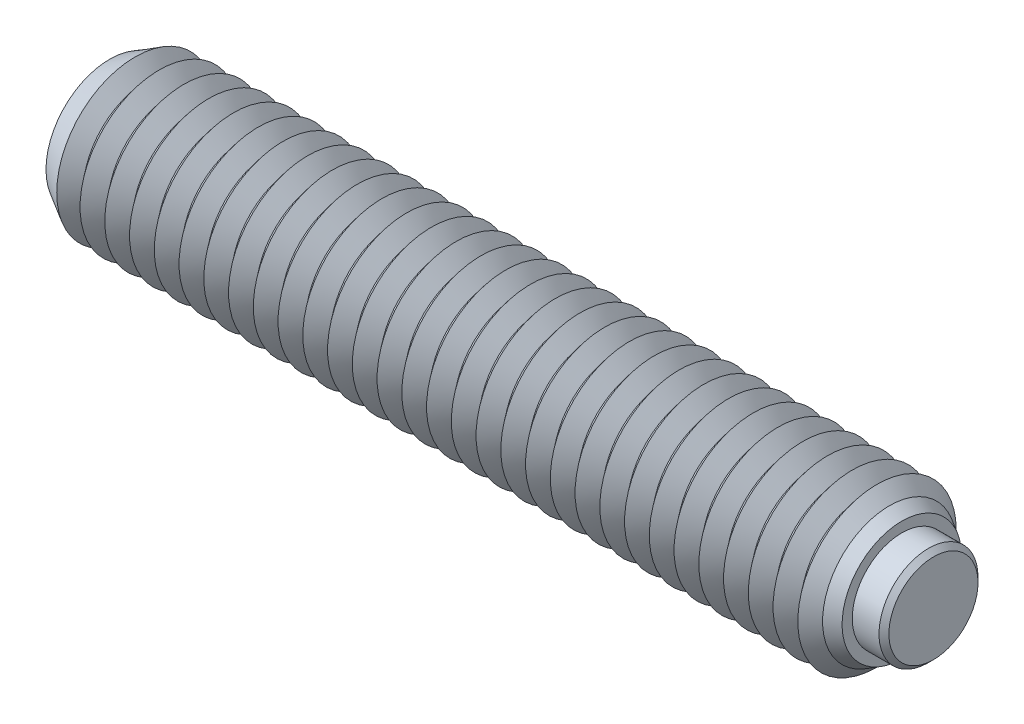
ISO-10303-21;
HEADER;
FILE_DESCRIPTION(('STEP AP214'),'2;1');
FILE_NAME('part.step','',(''),(''),'','','');
FILE_SCHEMA(('AUTOMOTIVE_DESIGN { 1 0 10303 214 1 1 1 1 }'));
ENDSEC;
DATA;
#1=APPLICATION_CONTEXT('core data for automotive mechanical design processes');
#2=APPLICATION_PROTOCOL_DEFINITION('international standard','automotive_design',2000,#1);
#3=PRODUCT_CONTEXT('',#1,'mechanical');
#4=PRODUCT('Part','Part','',(#3));
#5=PRODUCT_RELATED_PRODUCT_CATEGORY('part','',(#4));
#6=PRODUCT_DEFINITION_FORMATION('','',#4);
#7=PRODUCT_DEFINITION_CONTEXT('part definition',#1,'design');
#8=PRODUCT_DEFINITION('design','',#6,#7);
#9=PRODUCT_DEFINITION_SHAPE('','',#8);
#10=(LENGTH_UNIT() NAMED_UNIT(*) SI_UNIT(.MILLI.,.METRE.));
#11=(NAMED_UNIT(*) PLANE_ANGLE_UNIT() SI_UNIT($,.RADIAN.));
#12=(NAMED_UNIT(*) SI_UNIT($,.STERADIAN.) SOLID_ANGLE_UNIT());
#13=UNCERTAINTY_MEASURE_WITH_UNIT(LENGTH_MEASURE(1.E-05),#10,'distance_accuracy_value','');
#14=(GEOMETRIC_REPRESENTATION_CONTEXT(3) GLOBAL_UNCERTAINTY_ASSIGNED_CONTEXT((#13)) GLOBAL_UNIT_ASSIGNED_CONTEXT((#10,
#11,#12)) REPRESENTATION_CONTEXT('',''));
#15=CARTESIAN_POINT('',(0.,0.,0.));
#16=DIRECTION('',(0.,0.,1.));
#17=DIRECTION('',(1.,0.,0.));
#18=AXIS2_PLACEMENT_3D('',#15,#16,#17);
#19=CARTESIAN_POINT('',(2.225,0.,0.));
#20=DIRECTION('',(-1.,0.,0.));
#21=DIRECTION('',(0.,0.,1.));
#22=AXIS2_PLACEMENT_3D('',#19,#20,#21);
#23=CYLINDRICAL_SURFACE('',#22,2.5);
#24=CARTESIAN_POINT('',(1.975,0.,0.));
#25=DIRECTION('',(1.,0.,0.));
#26=DIRECTION('',(0.,0.,-1.));
#27=AXIS2_PLACEMENT_3D('',#24,#25,#26);
#28=CIRCLE('',#27,2.5);
#29=CARTESIAN_POINT('',(1.975,0.,-2.5));
#30=VERTEX_POINT('',#29);
#31=EDGE_CURVE('P0_E10',#30,#30,#28,.F.);
#32=ORIENTED_EDGE('',*,*,#31,.T.);
#33=EDGE_LOOP('',(#32));
#34=FACE_BOUND('',#33,.T.);
#35=CARTESIAN_POINT('',(-0.975,0.,0.));
#36=DIRECTION('',(1.,0.,0.));
#37=DIRECTION('',(0.,0.,-1.));
#38=AXIS2_PLACEMENT_3D('',#35,#36,#37);
#39=CIRCLE('',#38,2.5);
#40=CARTESIAN_POINT('',(-0.975,0.,-2.5));
#41=VERTEX_POINT('',#40);
#42=EDGE_CURVE('P0_E25',#41,#41,#39,.T.);
#43=ORIENTED_EDGE('',*,*,#42,.T.);
#44=EDGE_LOOP('',(#43));
#45=FACE_BOUND('',#44,.T.);
#46=ADVANCED_FACE('P0_F14',(#34,#45),#23,.T.);
#47=CARTESIAN_POINT('',(2.225,0.,0.));
#48=DIRECTION('',(1.,0.,0.));
#49=DIRECTION('',(0.,0.,-1.));
#50=AXIS2_PLACEMENT_3D('',#47,#48,#49);
#51=PLANE('',#50);
#52=CARTESIAN_POINT('',(2.225,0.,0.));
#53=DIRECTION('',(1.,0.,0.));
#54=DIRECTION('',(0.,0.,-1.));
#55=AXIS2_PLACEMENT_3D('',#52,#53,#54);
#56=CIRCLE('',#55,2.25);
#57=CARTESIAN_POINT('',(2.225,0.,-2.25));
#58=VERTEX_POINT('',#57);
#59=EDGE_CURVE('P0_E21',#58,#58,#56,.T.);
#60=ORIENTED_EDGE('',*,*,#59,.T.);
#61=EDGE_LOOP('',(#60));
#62=FACE_BOUND('',#61,.T.);
#63=ADVANCED_FACE('P0_F35',(#62),#51,.T.);
#64=CARTESIAN_POINT('',(-0.975,0.,0.));
#65=DIRECTION('',(1.,0.,0.));
#66=DIRECTION('',(0.,0.,-1.));
#67=AXIS2_PLACEMENT_3D('',#64,#65,#66);
#68=PLANE('',#67);
#69=ORIENTED_EDGE('',*,*,#42,.F.);
#70=EDGE_LOOP('',(#69));
#71=FACE_BOUND('',#70,.T.);
#72=ADVANCED_FACE('P0_F33',(#71),#68,.F.);
#73=CARTESIAN_POINT('',(2.225,0.,0.));
#74=DIRECTION('',(-1.,0.,0.));
#75=DIRECTION('',(0.,0.,1.));
#76=AXIS2_PLACEMENT_3D('',#73,#74,#75);
#77=CONICAL_SURFACE('',#76,2.25,0.785398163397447);
#78=ORIENTED_EDGE('',*,*,#31,.F.);
#79=EDGE_LOOP('',(#78));
#80=FACE_BOUND('',#79,.T.);
#81=ORIENTED_EDGE('',*,*,#59,.F.);
#82=EDGE_LOOP('',(#81));
#83=FACE_BOUND('',#82,.T.);
#84=ADVANCED_FACE('P0_F16',(#80,#83),#77,.T.);
#85=CLOSED_SHELL('',(#46,#63,#72,#84));
#86=MANIFOLD_SOLID_BREP('P0_B1',#85);
#87=CARTESIAN_POINT('',(-38.125,0.,0.));
#88=DIRECTION('',(-1.,0.,0.));
#89=DIRECTION('',(0.,0.,1.));
#90=AXIS2_PLACEMENT_3D('',#87,#88,#89);
#91=CONICAL_SURFACE('',#90,4.,0.895664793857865);
#92=CARTESIAN_POINT('',(-37.5,0.,0.));
#93=DIRECTION('',(1.,0.,0.));
#94=DIRECTION('',(0.,0.,-1.));
#95=AXIS2_PLACEMENT_3D('',#92,#93,#94);
#96=CIRCLE('',#95,3.2193752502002);
#97=CARTESIAN_POINT('',(-37.5,0.,-3.2193752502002));
#98=VERTEX_POINT('',#97);
#99=EDGE_CURVE('P1_E1269',#98,#98,#96,.T.);
#100=ORIENTED_EDGE('',*,*,#99,.F.);
#101=EDGE_LOOP('',(#100));
#102=FACE_BOUND('',#101,.T.);
#103=CARTESIAN_POINT('',(-38.092729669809,0.,0.));
#104=DIRECTION('',(1.,0.,0.));
#105=DIRECTION('',(0.,0.,-1.));
#106=AXIS2_PLACEMENT_3D('',#103,#104,#105);
#107=CIRCLE('',#106,3.95969437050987);
#108=CARTESIAN_POINT('',(-38.092729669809,0.,-3.95969437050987));
#109=VERTEX_POINT('',#108);
#110=EDGE_CURVE('P1_E1272',#109,#109,#107,.F.);
#111=ORIENTED_EDGE('',*,*,#110,.F.);
#112=EDGE_LOOP('',(#111));
#113=FACE_BOUND('',#112,.T.);
#114=ADVANCED_FACE('P1_F15',(#102,#113),#91,.T.);
#115=CARTESIAN_POINT('',(-1.25,0.,0.));
#116=DIRECTION('',(1.,0.,0.));
#117=DIRECTION('',(0.,0.,-1.));
#118=AXIS2_PLACEMENT_3D('',#115,#116,#117);
#119=CONICAL_SURFACE('',#118,3.2193752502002,0.895664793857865);
#120=CARTESIAN_POINT('',(-0.625000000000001,0.,0.));
#121=DIRECTION('',(1.,0.,0.));
#122=DIRECTION('',(0.,0.,-1.));
#123=AXIS2_PLACEMENT_3D('',#120,#121,#122);
#124=CIRCLE('',#123,4.);
#125=CARTESIAN_POINT('',(-0.625000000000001,0.,-4.));
#126=VERTEX_POINT('',#125);
#127=EDGE_CURVE('P1_E1091',#126,#126,#124,.T.);
#128=ORIENTED_EDGE('',*,*,#127,.F.);
#129=EDGE_LOOP('',(#128));
#130=FACE_BOUND('',#129,.T.);
#131=CARTESIAN_POINT('',(-1.25,0.,0.));
#132=DIRECTION('',(1.,0.,0.));
#133=DIRECTION('',(0.,0.,-1.));
#134=AXIS2_PLACEMENT_3D('',#131,#132,#133);
#135=CIRCLE('',#134,3.2193752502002);
#136=CARTESIAN_POINT('',(-1.25,0.,-3.2193752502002));
#137=VERTEX_POINT('',#136);
#138=EDGE_CURVE('P1_E1092',#137,#137,#135,.T.);
#139=ORIENTED_EDGE('',*,*,#138,.T.);
#140=EDGE_LOOP('',(#139));
#141=FACE_BOUND('',#140,.T.);
#142=ADVANCED_FACE('P1_F222',(#130,#141),#119,.T.);
#143=CARTESIAN_POINT('',(-1.875,0.,0.));
#144=DIRECTION('',(-1.,0.,0.));
#145=DIRECTION('',(0.,0.,1.));
#146=AXIS2_PLACEMENT_3D('',#143,#144,#145);
#147=CONICAL_SURFACE('',#146,4.,0.895664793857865);
#148=ORIENTED_EDGE('',*,*,#138,.F.);
#149=EDGE_LOOP('',(#148));
#150=FACE_BOUND('',#149,.T.);
#151=CARTESIAN_POINT('',(-1.875,0.,0.));
#152=DIRECTION('',(1.,0.,0.));
#153=DIRECTION('',(0.,0.,-1.));
#154=AXIS2_PLACEMENT_3D('',#151,#152,#153);
#155=CIRCLE('',#154,4.);
#156=CARTESIAN_POINT('',(-1.875,0.,-4.));
#157=VERTEX_POINT('',#156);
#158=EDGE_CURVE('P1_E1096',#157,#157,#155,.T.);
#159=ORIENTED_EDGE('',*,*,#158,.T.);
#160=EDGE_LOOP('',(#159));
#161=FACE_BOUND('',#160,.T.);
#162=ADVANCED_FACE('P1_F227',(#150,#161),#147,.T.);
#163=CARTESIAN_POINT('',(-0.975,0.,0.));
#164=DIRECTION('',(1.,0.,0.));
#165=DIRECTION('',(0.,1.,0.));
#166=AXIS2_PLACEMENT_3D('',#163,#164,#165);
#167=PLANE('',#166);
#168=CARTESIAN_POINT('',(-0.975,0.,0.));
#169=DIRECTION('',(1.,0.,0.));
#170=DIRECTION('',(0.,1.,0.));
#171=AXIS2_PLACEMENT_3D('',#168,#169,#170);
#172=CIRCLE('',#171,2.5);
#173=CARTESIAN_POINT('',(-0.975,2.5,0.));
#174=VERTEX_POINT('',#173);
#175=EDGE_CURVE('P1_E534',#174,#174,#172,.T.);
#176=ORIENTED_EDGE('',*,*,#175,.T.);
#177=EDGE_LOOP('',(#176));
#178=FACE_BOUND('',#177,.T.);
#179=ADVANCED_FACE('P1_F461',(#178),#167,.T.);
#180=CARTESIAN_POINT('',(-0.975,0.,0.));
#181=DIRECTION('',(1.,0.,0.));
#182=DIRECTION('',(0.,1.,0.));
#183=AXIS2_PLACEMENT_3D('',#180,#181,#182);
#184=CYLINDRICAL_SURFACE('',#183,2.5);
#185=ORIENTED_EDGE('',*,*,#175,.F.);
#186=EDGE_LOOP('',(#185));
#187=FACE_BOUND('',#186,.T.);
#188=CARTESIAN_POINT('',(0.625,0.,0.));
#189=DIRECTION('',(1.,0.,0.));
#190=DIRECTION('',(0.,1.,0.));
#191=AXIS2_PLACEMENT_3D('',#188,#189,#190);
#192=CIRCLE('',#191,2.5);
#193=CARTESIAN_POINT('',(0.625,2.5,0.));
#194=VERTEX_POINT('',#193);
#195=EDGE_CURVE('P1_E537',#194,#194,#192,.T.);
#196=ORIENTED_EDGE('',*,*,#195,.T.);
#197=EDGE_LOOP('',(#196));
#198=FACE_BOUND('',#197,.T.);
#199=ADVANCED_FACE('P1_F209',(#187,#198),#184,.F.);
#200=CARTESIAN_POINT('',(0.625,3.01415608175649,0.));
#201=DIRECTION('',(1.,0.,0.));
#202=DIRECTION('',(0.,1.,0.));
#203=AXIS2_PLACEMENT_3D('',#200,#201,#202);
#204=PLANE('',#203);
#205=ORIENTED_EDGE('',*,*,#195,.F.);
#206=EDGE_LOOP('',(#205));
#207=FACE_BOUND('',#206,.T.);
#208=CARTESIAN_POINT('',(0.625,0.,0.));
#209=DIRECTION('',(1.,0.,0.));
#210=DIRECTION('',(0.,1.,0.));
#211=AXIS2_PLACEMENT_3D('',#208,#209,#210);
#212=CIRCLE('',#211,3.01415608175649);
#213=CARTESIAN_POINT('',(0.625,3.01415608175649,0.));
#214=VERTEX_POINT('',#213);
#215=EDGE_CURVE('P1_E121',#214,#214,#212,.T.);
#216=ORIENTED_EDGE('',*,*,#215,.T.);
#217=EDGE_LOOP('',(#216));
#218=FACE_BOUND('',#217,.T.);
#219=ADVANCED_FACE('P1_F206',(#207,#218),#204,.T.);
#220=CARTESIAN_POINT('',(0.625,0.,0.));
#221=DIRECTION('',(-1.,0.,0.));
#222=DIRECTION('',(0.,-1.,0.));
#223=AXIS2_PLACEMENT_3D('',#220,#221,#222);
#224=CONICAL_SURFACE('',#223,3.01415608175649,0.523598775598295);
#225=CARTESIAN_POINT('',(0.,0.,0.));
#226=DIRECTION('',(1.,0.,0.));
#227=DIRECTION('',(0.,0.,-1.));
#228=AXIS2_PLACEMENT_3D('',#225,#226,#227);
#229=CIRCLE('',#228,3.375);
#230=CARTESIAN_POINT('',(0.,0.,-3.375));
#231=VERTEX_POINT('',#230);
#232=EDGE_CURVE('P1_E525',#231,#231,#229,.T.);
#233=ORIENTED_EDGE('',*,*,#232,.T.);
#234=EDGE_LOOP('',(#233));
#235=FACE_BOUND('',#234,.T.);
#236=ORIENTED_EDGE('',*,*,#215,.F.);
#237=EDGE_LOOP('',(#236));
#238=FACE_BOUND('',#237,.T.);
#239=ADVANCED_FACE('P1_F203',(#235,#238),#224,.T.);
#240=CARTESIAN_POINT('',(0.,0.,0.));
#241=DIRECTION('',(-1.,0.,0.));
#242=DIRECTION('',(0.,0.,1.));
#243=AXIS2_PLACEMENT_3D('',#240,#241,#242);
#244=CONICAL_SURFACE('',#243,3.375,0.785398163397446);
#245=ORIENTED_EDGE('',*,*,#127,.T.);
#246=EDGE_LOOP('',(#245));
#247=FACE_BOUND('',#246,.T.);
#248=ORIENTED_EDGE('',*,*,#232,.F.);
#249=EDGE_LOOP('',(#248));
#250=FACE_BOUND('',#249,.T.);
#251=ADVANCED_FACE('P1_F17',(#247,#250),#244,.T.);
#252=CARTESIAN_POINT('',(-2.5,0.,0.));
#253=DIRECTION('',(1.,0.,0.));
#254=DIRECTION('',(0.,0.,-1.));
#255=AXIS2_PLACEMENT_3D('',#252,#253,#254);
#256=CONICAL_SURFACE('',#255,3.2193752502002,0.895664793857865);
#257=ORIENTED_EDGE('',*,*,#158,.F.);
#258=EDGE_LOOP('',(#257));
#259=FACE_BOUND('',#258,.T.);
#260=CARTESIAN_POINT('',(-2.5,0.,0.));
#261=DIRECTION('',(1.,0.,0.));
#262=DIRECTION('',(0.,0.,-1.));
#263=AXIS2_PLACEMENT_3D('',#260,#261,#262);
#264=CIRCLE('',#263,3.2193752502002);
#265=CARTESIAN_POINT('',(-2.5,0.,-3.2193752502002));
#266=VERTEX_POINT('',#265);
#267=EDGE_CURVE('P1_E1101',#266,#266,#264,.T.);
#268=ORIENTED_EDGE('',*,*,#267,.T.);
#269=EDGE_LOOP('',(#268));
#270=FACE_BOUND('',#269,.T.);
#271=ADVANCED_FACE('P1_F455',(#259,#270),#256,.T.);
#272=CARTESIAN_POINT('',(-3.125,0.,0.));
#273=DIRECTION('',(-1.,0.,0.));
#274=DIRECTION('',(0.,0.,1.));
#275=AXIS2_PLACEMENT_3D('',#272,#273,#274);
#276=CONICAL_SURFACE('',#275,4.,0.895664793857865);
#277=ORIENTED_EDGE('',*,*,#267,.F.);
#278=EDGE_LOOP('',(#277));
#279=FACE_BOUND('',#278,.T.);
#280=CARTESIAN_POINT('',(-3.125,0.,0.));
#281=DIRECTION('',(1.,0.,0.));
#282=DIRECTION('',(0.,0.,-1.));
#283=AXIS2_PLACEMENT_3D('',#280,#281,#282);
#284=CIRCLE('',#283,4.);
#285=CARTESIAN_POINT('',(-3.125,0.,-4.));
#286=VERTEX_POINT('',#285);
#287=EDGE_CURVE('P1_E1104',#286,#286,#284,.T.);
#288=ORIENTED_EDGE('',*,*,#287,.T.);
#289=EDGE_LOOP('',(#288));
#290=FACE_BOUND('',#289,.T.);
#291=ADVANCED_FACE('P1_F451',(#279,#290),#276,.T.);
#292=CARTESIAN_POINT('',(-3.75,0.,0.));
#293=DIRECTION('',(1.,0.,0.));
#294=DIRECTION('',(0.,0.,-1.));
#295=AXIS2_PLACEMENT_3D('',#292,#293,#294);
#296=CONICAL_SURFACE('',#295,3.2193752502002,0.895664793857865);
#297=ORIENTED_EDGE('',*,*,#287,.F.);
#298=EDGE_LOOP('',(#297));
#299=FACE_BOUND('',#298,.T.);
#300=CARTESIAN_POINT('',(-3.75,0.,0.));
#301=DIRECTION('',(1.,0.,0.));
#302=DIRECTION('',(0.,0.,-1.));
#303=AXIS2_PLACEMENT_3D('',#300,#301,#302);
#304=CIRCLE('',#303,3.2193752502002);
#305=CARTESIAN_POINT('',(-3.75,0.,-3.2193752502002));
#306=VERTEX_POINT('',#305);
#307=EDGE_CURVE('P1_E1107',#306,#306,#304,.T.);
#308=ORIENTED_EDGE('',*,*,#307,.T.);
#309=EDGE_LOOP('',(#308));
#310=FACE_BOUND('',#309,.T.);
#311=ADVANCED_FACE('P1_F447',(#299,#310),#296,.T.);
#312=CARTESIAN_POINT('',(-4.375,0.,0.));
#313=DIRECTION('',(-1.,0.,0.));
#314=DIRECTION('',(0.,0.,1.));
#315=AXIS2_PLACEMENT_3D('',#312,#313,#314);
#316=CONICAL_SURFACE('',#315,4.,0.895664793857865);
#317=ORIENTED_EDGE('',*,*,#307,.F.);
#318=EDGE_LOOP('',(#317));
#319=FACE_BOUND('',#318,.T.);
#320=CARTESIAN_POINT('',(-4.375,0.,0.));
#321=DIRECTION('',(1.,0.,0.));
#322=DIRECTION('',(0.,0.,-1.));
#323=AXIS2_PLACEMENT_3D('',#320,#321,#322);
#324=CIRCLE('',#323,4.);
#325=CARTESIAN_POINT('',(-4.375,0.,-4.));
#326=VERTEX_POINT('',#325);
#327=EDGE_CURVE('P1_E1110',#326,#326,#324,.T.);
#328=ORIENTED_EDGE('',*,*,#327,.T.);
#329=EDGE_LOOP('',(#328));
#330=FACE_BOUND('',#329,.T.);
#331=ADVANCED_FACE('P1_F443',(#319,#330),#316,.T.);
#332=CARTESIAN_POINT('',(-5.,0.,0.));
#333=DIRECTION('',(1.,0.,0.));
#334=DIRECTION('',(0.,0.,-1.));
#335=AXIS2_PLACEMENT_3D('',#332,#333,#334);
#336=CONICAL_SURFACE('',#335,3.2193752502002,0.895664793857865);
#337=ORIENTED_EDGE('',*,*,#327,.F.);
#338=EDGE_LOOP('',(#337));
#339=FACE_BOUND('',#338,.T.);
#340=CARTESIAN_POINT('',(-5.,0.,0.));
#341=DIRECTION('',(1.,0.,0.));
#342=DIRECTION('',(0.,0.,-1.));
#343=AXIS2_PLACEMENT_3D('',#340,#341,#342);
#344=CIRCLE('',#343,3.2193752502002);
#345=CARTESIAN_POINT('',(-5.,0.,-3.2193752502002));
#346=VERTEX_POINT('',#345);
#347=EDGE_CURVE('P1_E1113',#346,#346,#344,.T.);
#348=ORIENTED_EDGE('',*,*,#347,.T.);
#349=EDGE_LOOP('',(#348));
#350=FACE_BOUND('',#349,.T.);
#351=ADVANCED_FACE('P1_F439',(#339,#350),#336,.T.);
#352=CARTESIAN_POINT('',(-5.625,0.,0.));
#353=DIRECTION('',(-1.,0.,0.));
#354=DIRECTION('',(0.,0.,1.));
#355=AXIS2_PLACEMENT_3D('',#352,#353,#354);
#356=CONICAL_SURFACE('',#355,4.,0.895664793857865);
#357=ORIENTED_EDGE('',*,*,#347,.F.);
#358=EDGE_LOOP('',(#357));
#359=FACE_BOUND('',#358,.T.);
#360=CARTESIAN_POINT('',(-5.625,0.,0.));
#361=DIRECTION('',(1.,0.,0.));
#362=DIRECTION('',(0.,0.,-1.));
#363=AXIS2_PLACEMENT_3D('',#360,#361,#362);
#364=CIRCLE('',#363,4.);
#365=CARTESIAN_POINT('',(-5.625,0.,-4.));
#366=VERTEX_POINT('',#365);
#367=EDGE_CURVE('P1_E1116',#366,#366,#364,.T.);
#368=ORIENTED_EDGE('',*,*,#367,.T.);
#369=EDGE_LOOP('',(#368));
#370=FACE_BOUND('',#369,.T.);
#371=ADVANCED_FACE('P1_F435',(#359,#370),#356,.T.);
#372=CARTESIAN_POINT('',(-6.25,0.,0.));
#373=DIRECTION('',(1.,0.,0.));
#374=DIRECTION('',(0.,0.,-1.));
#375=AXIS2_PLACEMENT_3D('',#372,#373,#374);
#376=CONICAL_SURFACE('',#375,3.2193752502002,0.895664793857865);
#377=ORIENTED_EDGE('',*,*,#367,.F.);
#378=EDGE_LOOP('',(#377));
#379=FACE_BOUND('',#378,.T.);
#380=CARTESIAN_POINT('',(-6.25,0.,0.));
#381=DIRECTION('',(1.,0.,0.));
#382=DIRECTION('',(0.,0.,-1.));
#383=AXIS2_PLACEMENT_3D('',#380,#381,#382);
#384=CIRCLE('',#383,3.2193752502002);
#385=CARTESIAN_POINT('',(-6.25,0.,-3.2193752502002));
#386=VERTEX_POINT('',#385);
#387=EDGE_CURVE('P1_E1119',#386,#386,#384,.T.);
#388=ORIENTED_EDGE('',*,*,#387,.T.);
#389=EDGE_LOOP('',(#388));
#390=FACE_BOUND('',#389,.T.);
#391=ADVANCED_FACE('P1_F431',(#379,#390),#376,.T.);
#392=CARTESIAN_POINT('',(-6.875,0.,0.));
#393=DIRECTION('',(-1.,0.,0.));
#394=DIRECTION('',(0.,0.,1.));
#395=AXIS2_PLACEMENT_3D('',#392,#393,#394);
#396=CONICAL_SURFACE('',#395,4.,0.895664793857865);
#397=ORIENTED_EDGE('',*,*,#387,.F.);
#398=EDGE_LOOP('',(#397));
#399=FACE_BOUND('',#398,.T.);
#400=CARTESIAN_POINT('',(-6.875,0.,0.));
#401=DIRECTION('',(1.,0.,0.));
#402=DIRECTION('',(0.,0.,-1.));
#403=AXIS2_PLACEMENT_3D('',#400,#401,#402);
#404=CIRCLE('',#403,4.);
#405=CARTESIAN_POINT('',(-6.875,0.,-4.));
#406=VERTEX_POINT('',#405);
#407=EDGE_CURVE('P1_E1122',#406,#406,#404,.T.);
#408=ORIENTED_EDGE('',*,*,#407,.T.);
#409=EDGE_LOOP('',(#408));
#410=FACE_BOUND('',#409,.T.);
#411=ADVANCED_FACE('P1_F427',(#399,#410),#396,.T.);
#412=CARTESIAN_POINT('',(-7.5,0.,0.));
#413=DIRECTION('',(1.,0.,0.));
#414=DIRECTION('',(0.,0.,-1.));
#415=AXIS2_PLACEMENT_3D('',#412,#413,#414);
#416=CONICAL_SURFACE('',#415,3.2193752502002,0.895664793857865);
#417=ORIENTED_EDGE('',*,*,#407,.F.);
#418=EDGE_LOOP('',(#417));
#419=FACE_BOUND('',#418,.T.);
#420=CARTESIAN_POINT('',(-7.5,0.,0.));
#421=DIRECTION('',(1.,0.,0.));
#422=DIRECTION('',(0.,0.,-1.));
#423=AXIS2_PLACEMENT_3D('',#420,#421,#422);
#424=CIRCLE('',#423,3.2193752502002);
#425=CARTESIAN_POINT('',(-7.5,0.,-3.2193752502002));
#426=VERTEX_POINT('',#425);
#427=EDGE_CURVE('P1_E1125',#426,#426,#424,.T.);
#428=ORIENTED_EDGE('',*,*,#427,.T.);
#429=EDGE_LOOP('',(#428));
#430=FACE_BOUND('',#429,.T.);
#431=ADVANCED_FACE('P1_F423',(#419,#430),#416,.T.);
#432=CARTESIAN_POINT('',(-8.125,0.,0.));
#433=DIRECTION('',(-1.,0.,0.));
#434=DIRECTION('',(0.,0.,1.));
#435=AXIS2_PLACEMENT_3D('',#432,#433,#434);
#436=CONICAL_SURFACE('',#435,4.,0.895664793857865);
#437=ORIENTED_EDGE('',*,*,#427,.F.);
#438=EDGE_LOOP('',(#437));
#439=FACE_BOUND('',#438,.T.);
#440=CARTESIAN_POINT('',(-8.125,0.,0.));
#441=DIRECTION('',(1.,0.,0.));
#442=DIRECTION('',(0.,0.,-1.));
#443=AXIS2_PLACEMENT_3D('',#440,#441,#442);
#444=CIRCLE('',#443,4.);
#445=CARTESIAN_POINT('',(-8.125,0.,-4.));
#446=VERTEX_POINT('',#445);
#447=EDGE_CURVE('P1_E1128',#446,#446,#444,.T.);
#448=ORIENTED_EDGE('',*,*,#447,.T.);
#449=EDGE_LOOP('',(#448));
#450=FACE_BOUND('',#449,.T.);
#451=ADVANCED_FACE('P1_F419',(#439,#450),#436,.T.);
#452=CARTESIAN_POINT('',(-8.75,0.,0.));
#453=DIRECTION('',(1.,0.,0.));
#454=DIRECTION('',(0.,0.,-1.));
#455=AXIS2_PLACEMENT_3D('',#452,#453,#454);
#456=CONICAL_SURFACE('',#455,3.2193752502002,0.895664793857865);
#457=ORIENTED_EDGE('',*,*,#447,.F.);
#458=EDGE_LOOP('',(#457));
#459=FACE_BOUND('',#458,.T.);
#460=CARTESIAN_POINT('',(-8.75,0.,0.));
#461=DIRECTION('',(1.,0.,0.));
#462=DIRECTION('',(0.,0.,-1.));
#463=AXIS2_PLACEMENT_3D('',#460,#461,#462);
#464=CIRCLE('',#463,3.2193752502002);
#465=CARTESIAN_POINT('',(-8.75,0.,-3.2193752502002));
#466=VERTEX_POINT('',#465);
#467=EDGE_CURVE('P1_E1131',#466,#466,#464,.T.);
#468=ORIENTED_EDGE('',*,*,#467,.T.);
#469=EDGE_LOOP('',(#468));
#470=FACE_BOUND('',#469,.T.);
#471=ADVANCED_FACE('P1_F415',(#459,#470),#456,.T.);
#472=CARTESIAN_POINT('',(-9.375,0.,0.));
#473=DIRECTION('',(-1.,0.,0.));
#474=DIRECTION('',(0.,0.,1.));
#475=AXIS2_PLACEMENT_3D('',#472,#473,#474);
#476=CONICAL_SURFACE('',#475,4.,0.895664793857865);
#477=ORIENTED_EDGE('',*,*,#467,.F.);
#478=EDGE_LOOP('',(#477));
#479=FACE_BOUND('',#478,.T.);
#480=CARTESIAN_POINT('',(-9.375,0.,0.));
#481=DIRECTION('',(1.,0.,0.));
#482=DIRECTION('',(0.,0.,-1.));
#483=AXIS2_PLACEMENT_3D('',#480,#481,#482);
#484=CIRCLE('',#483,4.);
#485=CARTESIAN_POINT('',(-9.375,0.,-4.));
#486=VERTEX_POINT('',#485);
#487=EDGE_CURVE('P1_E1134',#486,#486,#484,.T.);
#488=ORIENTED_EDGE('',*,*,#487,.T.);
#489=EDGE_LOOP('',(#488));
#490=FACE_BOUND('',#489,.T.);
#491=ADVANCED_FACE('P1_F411',(#479,#490),#476,.T.);
#492=CARTESIAN_POINT('',(-10.,0.,0.));
#493=DIRECTION('',(1.,0.,0.));
#494=DIRECTION('',(0.,0.,-1.));
#495=AXIS2_PLACEMENT_3D('',#492,#493,#494);
#496=CONICAL_SURFACE('',#495,3.2193752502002,0.895664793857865);
#497=ORIENTED_EDGE('',*,*,#487,.F.);
#498=EDGE_LOOP('',(#497));
#499=FACE_BOUND('',#498,.T.);
#500=CARTESIAN_POINT('',(-10.,0.,0.));
#501=DIRECTION('',(1.,0.,0.));
#502=DIRECTION('',(0.,0.,-1.));
#503=AXIS2_PLACEMENT_3D('',#500,#501,#502);
#504=CIRCLE('',#503,3.2193752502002);
#505=CARTESIAN_POINT('',(-10.,0.,-3.2193752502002));
#506=VERTEX_POINT('',#505);
#507=EDGE_CURVE('P1_E1137',#506,#506,#504,.T.);
#508=ORIENTED_EDGE('',*,*,#507,.T.);
#509=EDGE_LOOP('',(#508));
#510=FACE_BOUND('',#509,.T.);
#511=ADVANCED_FACE('P1_F407',(#499,#510),#496,.T.);
#512=CARTESIAN_POINT('',(-10.625,0.,0.));
#513=DIRECTION('',(-1.,0.,0.));
#514=DIRECTION('',(0.,0.,1.));
#515=AXIS2_PLACEMENT_3D('',#512,#513,#514);
#516=CONICAL_SURFACE('',#515,4.,0.895664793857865);
#517=ORIENTED_EDGE('',*,*,#507,.F.);
#518=EDGE_LOOP('',(#517));
#519=FACE_BOUND('',#518,.T.);
#520=CARTESIAN_POINT('',(-10.625,0.,0.));
#521=DIRECTION('',(1.,0.,0.));
#522=DIRECTION('',(0.,0.,-1.));
#523=AXIS2_PLACEMENT_3D('',#520,#521,#522);
#524=CIRCLE('',#523,4.);
#525=CARTESIAN_POINT('',(-10.625,0.,-4.));
#526=VERTEX_POINT('',#525);
#527=EDGE_CURVE('P1_E1140',#526,#526,#524,.T.);
#528=ORIENTED_EDGE('',*,*,#527,.T.);
#529=EDGE_LOOP('',(#528));
#530=FACE_BOUND('',#529,.T.);
#531=ADVANCED_FACE('P1_F403',(#519,#530),#516,.T.);
#532=CARTESIAN_POINT('',(-11.25,0.,0.));
#533=DIRECTION('',(1.,0.,0.));
#534=DIRECTION('',(0.,0.,-1.));
#535=AXIS2_PLACEMENT_3D('',#532,#533,#534);
#536=CONICAL_SURFACE('',#535,3.2193752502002,0.895664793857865);
#537=ORIENTED_EDGE('',*,*,#527,.F.);
#538=EDGE_LOOP('',(#537));
#539=FACE_BOUND('',#538,.T.);
#540=CARTESIAN_POINT('',(-11.25,0.,0.));
#541=DIRECTION('',(1.,0.,0.));
#542=DIRECTION('',(0.,0.,-1.));
#543=AXIS2_PLACEMENT_3D('',#540,#541,#542);
#544=CIRCLE('',#543,3.2193752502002);
#545=CARTESIAN_POINT('',(-11.25,0.,-3.2193752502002));
#546=VERTEX_POINT('',#545);
#547=EDGE_CURVE('P1_E1143',#546,#546,#544,.T.);
#548=ORIENTED_EDGE('',*,*,#547,.T.);
#549=EDGE_LOOP('',(#548));
#550=FACE_BOUND('',#549,.T.);
#551=ADVANCED_FACE('P1_F399',(#539,#550),#536,.T.);
#552=CARTESIAN_POINT('',(-11.875,0.,0.));
#553=DIRECTION('',(-1.,0.,0.));
#554=DIRECTION('',(0.,0.,1.));
#555=AXIS2_PLACEMENT_3D('',#552,#553,#554);
#556=CONICAL_SURFACE('',#555,4.,0.895664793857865);
#557=ORIENTED_EDGE('',*,*,#547,.F.);
#558=EDGE_LOOP('',(#557));
#559=FACE_BOUND('',#558,.T.);
#560=CARTESIAN_POINT('',(-11.875,0.,0.));
#561=DIRECTION('',(1.,0.,0.));
#562=DIRECTION('',(0.,0.,-1.));
#563=AXIS2_PLACEMENT_3D('',#560,#561,#562);
#564=CIRCLE('',#563,4.);
#565=CARTESIAN_POINT('',(-11.875,0.,-4.));
#566=VERTEX_POINT('',#565);
#567=EDGE_CURVE('P1_E1146',#566,#566,#564,.T.);
#568=ORIENTED_EDGE('',*,*,#567,.T.);
#569=EDGE_LOOP('',(#568));
#570=FACE_BOUND('',#569,.T.);
#571=ADVANCED_FACE('P1_F395',(#559,#570),#556,.T.);
#572=CARTESIAN_POINT('',(-12.5,0.,0.));
#573=DIRECTION('',(1.,0.,0.));
#574=DIRECTION('',(0.,0.,-1.));
#575=AXIS2_PLACEMENT_3D('',#572,#573,#574);
#576=CONICAL_SURFACE('',#575,3.2193752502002,0.895664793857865);
#577=ORIENTED_EDGE('',*,*,#567,.F.);
#578=EDGE_LOOP('',(#577));
#579=FACE_BOUND('',#578,.T.);
#580=CARTESIAN_POINT('',(-12.5,0.,0.));
#581=DIRECTION('',(1.,0.,0.));
#582=DIRECTION('',(0.,0.,-1.));
#583=AXIS2_PLACEMENT_3D('',#580,#581,#582);
#584=CIRCLE('',#583,3.2193752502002);
#585=CARTESIAN_POINT('',(-12.5,0.,-3.2193752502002));
#586=VERTEX_POINT('',#585);
#587=EDGE_CURVE('P1_E1149',#586,#586,#584,.T.);
#588=ORIENTED_EDGE('',*,*,#587,.T.);
#589=EDGE_LOOP('',(#588));
#590=FACE_BOUND('',#589,.T.);
#591=ADVANCED_FACE('P1_F391',(#579,#590),#576,.T.);
#592=CARTESIAN_POINT('',(-13.125,0.,0.));
#593=DIRECTION('',(-1.,0.,0.));
#594=DIRECTION('',(0.,0.,1.));
#595=AXIS2_PLACEMENT_3D('',#592,#593,#594);
#596=CONICAL_SURFACE('',#595,4.,0.895664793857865);
#597=ORIENTED_EDGE('',*,*,#587,.F.);
#598=EDGE_LOOP('',(#597));
#599=FACE_BOUND('',#598,.T.);
#600=CARTESIAN_POINT('',(-13.125,0.,0.));
#601=DIRECTION('',(1.,0.,0.));
#602=DIRECTION('',(0.,0.,-1.));
#603=AXIS2_PLACEMENT_3D('',#600,#601,#602);
#604=CIRCLE('',#603,4.);
#605=CARTESIAN_POINT('',(-13.125,0.,-4.));
#606=VERTEX_POINT('',#605);
#607=EDGE_CURVE('P1_E1152',#606,#606,#604,.T.);
#608=ORIENTED_EDGE('',*,*,#607,.T.);
#609=EDGE_LOOP('',(#608));
#610=FACE_BOUND('',#609,.T.);
#611=ADVANCED_FACE('P1_F387',(#599,#610),#596,.T.);
#612=CARTESIAN_POINT('',(-13.75,0.,0.));
#613=DIRECTION('',(1.,0.,0.));
#614=DIRECTION('',(0.,0.,-1.));
#615=AXIS2_PLACEMENT_3D('',#612,#613,#614);
#616=CONICAL_SURFACE('',#615,3.2193752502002,0.895664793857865);
#617=ORIENTED_EDGE('',*,*,#607,.F.);
#618=EDGE_LOOP('',(#617));
#619=FACE_BOUND('',#618,.T.);
#620=CARTESIAN_POINT('',(-13.75,0.,0.));
#621=DIRECTION('',(1.,0.,0.));
#622=DIRECTION('',(0.,0.,-1.));
#623=AXIS2_PLACEMENT_3D('',#620,#621,#622);
#624=CIRCLE('',#623,3.2193752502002);
#625=CARTESIAN_POINT('',(-13.75,0.,-3.2193752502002));
#626=VERTEX_POINT('',#625);
#627=EDGE_CURVE('P1_E1155',#626,#626,#624,.T.);
#628=ORIENTED_EDGE('',*,*,#627,.T.);
#629=EDGE_LOOP('',(#628));
#630=FACE_BOUND('',#629,.T.);
#631=ADVANCED_FACE('P1_F383',(#619,#630),#616,.T.);
#632=CARTESIAN_POINT('',(-14.375,0.,0.));
#633=DIRECTION('',(-1.,0.,0.));
#634=DIRECTION('',(0.,0.,1.));
#635=AXIS2_PLACEMENT_3D('',#632,#633,#634);
#636=CONICAL_SURFACE('',#635,4.,0.895664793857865);
#637=ORIENTED_EDGE('',*,*,#627,.F.);
#638=EDGE_LOOP('',(#637));
#639=FACE_BOUND('',#638,.T.);
#640=CARTESIAN_POINT('',(-14.375,0.,0.));
#641=DIRECTION('',(1.,0.,0.));
#642=DIRECTION('',(0.,0.,-1.));
#643=AXIS2_PLACEMENT_3D('',#640,#641,#642);
#644=CIRCLE('',#643,4.);
#645=CARTESIAN_POINT('',(-14.375,0.,-4.));
#646=VERTEX_POINT('',#645);
#647=EDGE_CURVE('P1_E1158',#646,#646,#644,.T.);
#648=ORIENTED_EDGE('',*,*,#647,.T.);
#649=EDGE_LOOP('',(#648));
#650=FACE_BOUND('',#649,.T.);
#651=ADVANCED_FACE('P1_F379',(#639,#650),#636,.T.);
#652=CARTESIAN_POINT('',(-15.,0.,0.));
#653=DIRECTION('',(1.,0.,0.));
#654=DIRECTION('',(0.,0.,-1.));
#655=AXIS2_PLACEMENT_3D('',#652,#653,#654);
#656=CONICAL_SURFACE('',#655,3.2193752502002,0.895664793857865);
#657=ORIENTED_EDGE('',*,*,#647,.F.);
#658=EDGE_LOOP('',(#657));
#659=FACE_BOUND('',#658,.T.);
#660=CARTESIAN_POINT('',(-15.,0.,0.));
#661=DIRECTION('',(1.,0.,0.));
#662=DIRECTION('',(0.,0.,-1.));
#663=AXIS2_PLACEMENT_3D('',#660,#661,#662);
#664=CIRCLE('',#663,3.2193752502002);
#665=CARTESIAN_POINT('',(-15.,0.,-3.2193752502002));
#666=VERTEX_POINT('',#665);
#667=EDGE_CURVE('P1_E1161',#666,#666,#664,.T.);
#668=ORIENTED_EDGE('',*,*,#667,.T.);
#669=EDGE_LOOP('',(#668));
#670=FACE_BOUND('',#669,.T.);
#671=ADVANCED_FACE('P1_F375',(#659,#670),#656,.T.);
#672=CARTESIAN_POINT('',(-15.625,0.,0.));
#673=DIRECTION('',(-1.,0.,0.));
#674=DIRECTION('',(0.,0.,1.));
#675=AXIS2_PLACEMENT_3D('',#672,#673,#674);
#676=CONICAL_SURFACE('',#675,4.,0.895664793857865);
#677=ORIENTED_EDGE('',*,*,#667,.F.);
#678=EDGE_LOOP('',(#677));
#679=FACE_BOUND('',#678,.T.);
#680=CARTESIAN_POINT('',(-15.625,0.,0.));
#681=DIRECTION('',(1.,0.,0.));
#682=DIRECTION('',(0.,0.,-1.));
#683=AXIS2_PLACEMENT_3D('',#680,#681,#682);
#684=CIRCLE('',#683,4.);
#685=CARTESIAN_POINT('',(-15.625,0.,-4.));
#686=VERTEX_POINT('',#685);
#687=EDGE_CURVE('P1_E1164',#686,#686,#684,.T.);
#688=ORIENTED_EDGE('',*,*,#687,.T.);
#689=EDGE_LOOP('',(#688));
#690=FACE_BOUND('',#689,.T.);
#691=ADVANCED_FACE('P1_F371',(#679,#690),#676,.T.);
#692=CARTESIAN_POINT('',(-16.25,0.,0.));
#693=DIRECTION('',(1.,0.,0.));
#694=DIRECTION('',(0.,0.,-1.));
#695=AXIS2_PLACEMENT_3D('',#692,#693,#694);
#696=CONICAL_SURFACE('',#695,3.2193752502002,0.895664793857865);
#697=ORIENTED_EDGE('',*,*,#687,.F.);
#698=EDGE_LOOP('',(#697));
#699=FACE_BOUND('',#698,.T.);
#700=CARTESIAN_POINT('',(-16.25,0.,0.));
#701=DIRECTION('',(1.,0.,0.));
#702=DIRECTION('',(0.,0.,-1.));
#703=AXIS2_PLACEMENT_3D('',#700,#701,#702);
#704=CIRCLE('',#703,3.2193752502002);
#705=CARTESIAN_POINT('',(-16.25,0.,-3.2193752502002));
#706=VERTEX_POINT('',#705);
#707=EDGE_CURVE('P1_E1167',#706,#706,#704,.T.);
#708=ORIENTED_EDGE('',*,*,#707,.T.);
#709=EDGE_LOOP('',(#708));
#710=FACE_BOUND('',#709,.T.);
#711=ADVANCED_FACE('P1_F367',(#699,#710),#696,.T.);
#712=CARTESIAN_POINT('',(-16.875,0.,0.));
#713=DIRECTION('',(-1.,0.,0.));
#714=DIRECTION('',(0.,0.,1.));
#715=AXIS2_PLACEMENT_3D('',#712,#713,#714);
#716=CONICAL_SURFACE('',#715,4.,0.895664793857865);
#717=ORIENTED_EDGE('',*,*,#707,.F.);
#718=EDGE_LOOP('',(#717));
#719=FACE_BOUND('',#718,.T.);
#720=CARTESIAN_POINT('',(-16.875,0.,0.));
#721=DIRECTION('',(1.,0.,0.));
#722=DIRECTION('',(0.,0.,-1.));
#723=AXIS2_PLACEMENT_3D('',#720,#721,#722);
#724=CIRCLE('',#723,4.);
#725=CARTESIAN_POINT('',(-16.875,0.,-4.));
#726=VERTEX_POINT('',#725);
#727=EDGE_CURVE('P1_E1170',#726,#726,#724,.T.);
#728=ORIENTED_EDGE('',*,*,#727,.T.);
#729=EDGE_LOOP('',(#728));
#730=FACE_BOUND('',#729,.T.);
#731=ADVANCED_FACE('P1_F363',(#719,#730),#716,.T.);
#732=CARTESIAN_POINT('',(-17.5,0.,0.));
#733=DIRECTION('',(1.,0.,0.));
#734=DIRECTION('',(0.,0.,-1.));
#735=AXIS2_PLACEMENT_3D('',#732,#733,#734);
#736=CONICAL_SURFACE('',#735,3.2193752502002,0.895664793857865);
#737=ORIENTED_EDGE('',*,*,#727,.F.);
#738=EDGE_LOOP('',(#737));
#739=FACE_BOUND('',#738,.T.);
#740=CARTESIAN_POINT('',(-17.5,0.,0.));
#741=DIRECTION('',(1.,0.,0.));
#742=DIRECTION('',(0.,0.,-1.));
#743=AXIS2_PLACEMENT_3D('',#740,#741,#742);
#744=CIRCLE('',#743,3.2193752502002);
#745=CARTESIAN_POINT('',(-17.5,0.,-3.2193752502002));
#746=VERTEX_POINT('',#745);
#747=EDGE_CURVE('P1_E1173',#746,#746,#744,.T.);
#748=ORIENTED_EDGE('',*,*,#747,.T.);
#749=EDGE_LOOP('',(#748));
#750=FACE_BOUND('',#749,.T.);
#751=ADVANCED_FACE('P1_F359',(#739,#750),#736,.T.);
#752=CARTESIAN_POINT('',(-18.125,0.,0.));
#753=DIRECTION('',(-1.,0.,0.));
#754=DIRECTION('',(0.,0.,1.));
#755=AXIS2_PLACEMENT_3D('',#752,#753,#754);
#756=CONICAL_SURFACE('',#755,4.,0.895664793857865);
#757=ORIENTED_EDGE('',*,*,#747,.F.);
#758=EDGE_LOOP('',(#757));
#759=FACE_BOUND('',#758,.T.);
#760=CARTESIAN_POINT('',(-18.125,0.,0.));
#761=DIRECTION('',(1.,0.,0.));
#762=DIRECTION('',(0.,0.,-1.));
#763=AXIS2_PLACEMENT_3D('',#760,#761,#762);
#764=CIRCLE('',#763,4.);
#765=CARTESIAN_POINT('',(-18.125,0.,-4.));
#766=VERTEX_POINT('',#765);
#767=EDGE_CURVE('P1_E1176',#766,#766,#764,.T.);
#768=ORIENTED_EDGE('',*,*,#767,.T.);
#769=EDGE_LOOP('',(#768));
#770=FACE_BOUND('',#769,.T.);
#771=ADVANCED_FACE('P1_F355',(#759,#770),#756,.T.);
#772=CARTESIAN_POINT('',(-18.75,0.,0.));
#773=DIRECTION('',(1.,0.,0.));
#774=DIRECTION('',(0.,0.,-1.));
#775=AXIS2_PLACEMENT_3D('',#772,#773,#774);
#776=CONICAL_SURFACE('',#775,3.2193752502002,0.895664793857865);
#777=ORIENTED_EDGE('',*,*,#767,.F.);
#778=EDGE_LOOP('',(#777));
#779=FACE_BOUND('',#778,.T.);
#780=CARTESIAN_POINT('',(-18.75,0.,0.));
#781=DIRECTION('',(1.,0.,0.));
#782=DIRECTION('',(0.,0.,-1.));
#783=AXIS2_PLACEMENT_3D('',#780,#781,#782);
#784=CIRCLE('',#783,3.2193752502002);
#785=CARTESIAN_POINT('',(-18.75,0.,-3.2193752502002));
#786=VERTEX_POINT('',#785);
#787=EDGE_CURVE('P1_E1179',#786,#786,#784,.T.);
#788=ORIENTED_EDGE('',*,*,#787,.T.);
#789=EDGE_LOOP('',(#788));
#790=FACE_BOUND('',#789,.T.);
#791=ADVANCED_FACE('P1_F351',(#779,#790),#776,.T.);
#792=CARTESIAN_POINT('',(-19.375,0.,0.));
#793=DIRECTION('',(-1.,0.,0.));
#794=DIRECTION('',(0.,0.,1.));
#795=AXIS2_PLACEMENT_3D('',#792,#793,#794);
#796=CONICAL_SURFACE('',#795,4.,0.895664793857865);
#797=ORIENTED_EDGE('',*,*,#787,.F.);
#798=EDGE_LOOP('',(#797));
#799=FACE_BOUND('',#798,.T.);
#800=CARTESIAN_POINT('',(-19.375,0.,0.));
#801=DIRECTION('',(1.,0.,0.));
#802=DIRECTION('',(0.,0.,-1.));
#803=AXIS2_PLACEMENT_3D('',#800,#801,#802);
#804=CIRCLE('',#803,4.);
#805=CARTESIAN_POINT('',(-19.375,0.,-4.));
#806=VERTEX_POINT('',#805);
#807=EDGE_CURVE('P1_E1182',#806,#806,#804,.T.);
#808=ORIENTED_EDGE('',*,*,#807,.T.);
#809=EDGE_LOOP('',(#808));
#810=FACE_BOUND('',#809,.T.);
#811=ADVANCED_FACE('P1_F347',(#799,#810),#796,.T.);
#812=CARTESIAN_POINT('',(-20.,0.,0.));
#813=DIRECTION('',(1.,0.,0.));
#814=DIRECTION('',(0.,0.,-1.));
#815=AXIS2_PLACEMENT_3D('',#812,#813,#814);
#816=CONICAL_SURFACE('',#815,3.2193752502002,0.895664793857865);
#817=ORIENTED_EDGE('',*,*,#807,.F.);
#818=EDGE_LOOP('',(#817));
#819=FACE_BOUND('',#818,.T.);
#820=CARTESIAN_POINT('',(-20.,0.,0.));
#821=DIRECTION('',(1.,0.,0.));
#822=DIRECTION('',(0.,0.,-1.));
#823=AXIS2_PLACEMENT_3D('',#820,#821,#822);
#824=CIRCLE('',#823,3.2193752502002);
#825=CARTESIAN_POINT('',(-20.,0.,-3.2193752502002));
#826=VERTEX_POINT('',#825);
#827=EDGE_CURVE('P1_E1185',#826,#826,#824,.T.);
#828=ORIENTED_EDGE('',*,*,#827,.T.);
#829=EDGE_LOOP('',(#828));
#830=FACE_BOUND('',#829,.T.);
#831=ADVANCED_FACE('P1_F343',(#819,#830),#816,.T.);
#832=CARTESIAN_POINT('',(-20.625,0.,0.));
#833=DIRECTION('',(-1.,0.,0.));
#834=DIRECTION('',(0.,0.,1.));
#835=AXIS2_PLACEMENT_3D('',#832,#833,#834);
#836=CONICAL_SURFACE('',#835,4.,0.895664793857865);
#837=ORIENTED_EDGE('',*,*,#827,.F.);
#838=EDGE_LOOP('',(#837));
#839=FACE_BOUND('',#838,.T.);
#840=CARTESIAN_POINT('',(-20.625,0.,0.));
#841=DIRECTION('',(1.,0.,0.));
#842=DIRECTION('',(0.,0.,-1.));
#843=AXIS2_PLACEMENT_3D('',#840,#841,#842);
#844=CIRCLE('',#843,4.);
#845=CARTESIAN_POINT('',(-20.625,0.,-4.));
#846=VERTEX_POINT('',#845);
#847=EDGE_CURVE('P1_E1188',#846,#846,#844,.T.);
#848=ORIENTED_EDGE('',*,*,#847,.T.);
#849=EDGE_LOOP('',(#848));
#850=FACE_BOUND('',#849,.T.);
#851=ADVANCED_FACE('P1_F339',(#839,#850),#836,.T.);
#852=CARTESIAN_POINT('',(-21.25,0.,0.));
#853=DIRECTION('',(1.,0.,0.));
#854=DIRECTION('',(0.,0.,-1.));
#855=AXIS2_PLACEMENT_3D('',#852,#853,#854);
#856=CONICAL_SURFACE('',#855,3.2193752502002,0.895664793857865);
#857=ORIENTED_EDGE('',*,*,#847,.F.);
#858=EDGE_LOOP('',(#857));
#859=FACE_BOUND('',#858,.T.);
#860=CARTESIAN_POINT('',(-21.25,0.,0.));
#861=DIRECTION('',(1.,0.,0.));
#862=DIRECTION('',(0.,0.,-1.));
#863=AXIS2_PLACEMENT_3D('',#860,#861,#862);
#864=CIRCLE('',#863,3.2193752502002);
#865=CARTESIAN_POINT('',(-21.25,0.,-3.2193752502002));
#866=VERTEX_POINT('',#865);
#867=EDGE_CURVE('P1_E1191',#866,#866,#864,.T.);
#868=ORIENTED_EDGE('',*,*,#867,.T.);
#869=EDGE_LOOP('',(#868));
#870=FACE_BOUND('',#869,.T.);
#871=ADVANCED_FACE('P1_F335',(#859,#870),#856,.T.);
#872=CARTESIAN_POINT('',(-21.875,0.,0.));
#873=DIRECTION('',(-1.,0.,0.));
#874=DIRECTION('',(0.,0.,1.));
#875=AXIS2_PLACEMENT_3D('',#872,#873,#874);
#876=CONICAL_SURFACE('',#875,4.,0.895664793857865);
#877=ORIENTED_EDGE('',*,*,#867,.F.);
#878=EDGE_LOOP('',(#877));
#879=FACE_BOUND('',#878,.T.);
#880=CARTESIAN_POINT('',(-21.875,0.,0.));
#881=DIRECTION('',(1.,0.,0.));
#882=DIRECTION('',(0.,0.,-1.));
#883=AXIS2_PLACEMENT_3D('',#880,#881,#882);
#884=CIRCLE('',#883,4.);
#885=CARTESIAN_POINT('',(-21.875,0.,-4.));
#886=VERTEX_POINT('',#885);
#887=EDGE_CURVE('P1_E1194',#886,#886,#884,.T.);
#888=ORIENTED_EDGE('',*,*,#887,.T.);
#889=EDGE_LOOP('',(#888));
#890=FACE_BOUND('',#889,.T.);
#891=ADVANCED_FACE('P1_F331',(#879,#890),#876,.T.);
#892=CARTESIAN_POINT('',(-22.5,0.,0.));
#893=DIRECTION('',(1.,0.,0.));
#894=DIRECTION('',(0.,0.,-1.));
#895=AXIS2_PLACEMENT_3D('',#892,#893,#894);
#896=CONICAL_SURFACE('',#895,3.2193752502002,0.895664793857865);
#897=ORIENTED_EDGE('',*,*,#887,.F.);
#898=EDGE_LOOP('',(#897));
#899=FACE_BOUND('',#898,.T.);
#900=CARTESIAN_POINT('',(-22.5,0.,0.));
#901=DIRECTION('',(1.,0.,0.));
#902=DIRECTION('',(0.,0.,-1.));
#903=AXIS2_PLACEMENT_3D('',#900,#901,#902);
#904=CIRCLE('',#903,3.2193752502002);
#905=CARTESIAN_POINT('',(-22.5,0.,-3.2193752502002));
#906=VERTEX_POINT('',#905);
#907=EDGE_CURVE('P1_E1197',#906,#906,#904,.T.);
#908=ORIENTED_EDGE('',*,*,#907,.T.);
#909=EDGE_LOOP('',(#908));
#910=FACE_BOUND('',#909,.T.);
#911=ADVANCED_FACE('P1_F327',(#899,#910),#896,.T.);
#912=CARTESIAN_POINT('',(-23.125,0.,0.));
#913=DIRECTION('',(-1.,0.,0.));
#914=DIRECTION('',(0.,0.,1.));
#915=AXIS2_PLACEMENT_3D('',#912,#913,#914);
#916=CONICAL_SURFACE('',#915,4.,0.895664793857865);
#917=ORIENTED_EDGE('',*,*,#907,.F.);
#918=EDGE_LOOP('',(#917));
#919=FACE_BOUND('',#918,.T.);
#920=CARTESIAN_POINT('',(-23.125,0.,0.));
#921=DIRECTION('',(1.,0.,0.));
#922=DIRECTION('',(0.,0.,-1.));
#923=AXIS2_PLACEMENT_3D('',#920,#921,#922);
#924=CIRCLE('',#923,4.);
#925=CARTESIAN_POINT('',(-23.125,0.,-4.));
#926=VERTEX_POINT('',#925);
#927=EDGE_CURVE('P1_E1200',#926,#926,#924,.T.);
#928=ORIENTED_EDGE('',*,*,#927,.T.);
#929=EDGE_LOOP('',(#928));
#930=FACE_BOUND('',#929,.T.);
#931=ADVANCED_FACE('P1_F323',(#919,#930),#916,.T.);
#932=CARTESIAN_POINT('',(-23.75,0.,0.));
#933=DIRECTION('',(1.,0.,0.));
#934=DIRECTION('',(0.,0.,-1.));
#935=AXIS2_PLACEMENT_3D('',#932,#933,#934);
#936=CONICAL_SURFACE('',#935,3.2193752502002,0.895664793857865);
#937=ORIENTED_EDGE('',*,*,#927,.F.);
#938=EDGE_LOOP('',(#937));
#939=FACE_BOUND('',#938,.T.);
#940=CARTESIAN_POINT('',(-23.75,0.,0.));
#941=DIRECTION('',(1.,0.,0.));
#942=DIRECTION('',(0.,0.,-1.));
#943=AXIS2_PLACEMENT_3D('',#940,#941,#942);
#944=CIRCLE('',#943,3.2193752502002);
#945=CARTESIAN_POINT('',(-23.75,0.,-3.2193752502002));
#946=VERTEX_POINT('',#945);
#947=EDGE_CURVE('P1_E1203',#946,#946,#944,.T.);
#948=ORIENTED_EDGE('',*,*,#947,.T.);
#949=EDGE_LOOP('',(#948));
#950=FACE_BOUND('',#949,.T.);
#951=ADVANCED_FACE('P1_F319',(#939,#950),#936,.T.);
#952=CARTESIAN_POINT('',(-24.375,0.,0.));
#953=DIRECTION('',(-1.,0.,0.));
#954=DIRECTION('',(0.,0.,1.));
#955=AXIS2_PLACEMENT_3D('',#952,#953,#954);
#956=CONICAL_SURFACE('',#955,4.,0.895664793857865);
#957=ORIENTED_EDGE('',*,*,#947,.F.);
#958=EDGE_LOOP('',(#957));
#959=FACE_BOUND('',#958,.T.);
#960=CARTESIAN_POINT('',(-24.375,0.,0.));
#961=DIRECTION('',(1.,0.,0.));
#962=DIRECTION('',(0.,0.,-1.));
#963=AXIS2_PLACEMENT_3D('',#960,#961,#962);
#964=CIRCLE('',#963,4.);
#965=CARTESIAN_POINT('',(-24.375,0.,-4.));
#966=VERTEX_POINT('',#965);
#967=EDGE_CURVE('P1_E1206',#966,#966,#964,.T.);
#968=ORIENTED_EDGE('',*,*,#967,.T.);
#969=EDGE_LOOP('',(#968));
#970=FACE_BOUND('',#969,.T.);
#971=ADVANCED_FACE('P1_F315',(#959,#970),#956,.T.);
#972=CARTESIAN_POINT('',(-25.,0.,0.));
#973=DIRECTION('',(1.,0.,0.));
#974=DIRECTION('',(0.,0.,-1.));
#975=AXIS2_PLACEMENT_3D('',#972,#973,#974);
#976=CONICAL_SURFACE('',#975,3.2193752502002,0.895664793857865);
#977=ORIENTED_EDGE('',*,*,#967,.F.);
#978=EDGE_LOOP('',(#977));
#979=FACE_BOUND('',#978,.T.);
#980=CARTESIAN_POINT('',(-25.,0.,0.));
#981=DIRECTION('',(1.,0.,0.));
#982=DIRECTION('',(0.,0.,-1.));
#983=AXIS2_PLACEMENT_3D('',#980,#981,#982);
#984=CIRCLE('',#983,3.2193752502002);
#985=CARTESIAN_POINT('',(-25.,0.,-3.2193752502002));
#986=VERTEX_POINT('',#985);
#987=EDGE_CURVE('P1_E1209',#986,#986,#984,.T.);
#988=ORIENTED_EDGE('',*,*,#987,.T.);
#989=EDGE_LOOP('',(#988));
#990=FACE_BOUND('',#989,.T.);
#991=ADVANCED_FACE('P1_F311',(#979,#990),#976,.T.);
#992=CARTESIAN_POINT('',(-25.625,0.,0.));
#993=DIRECTION('',(-1.,0.,0.));
#994=DIRECTION('',(0.,0.,1.));
#995=AXIS2_PLACEMENT_3D('',#992,#993,#994);
#996=CONICAL_SURFACE('',#995,4.,0.895664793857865);
#997=ORIENTED_EDGE('',*,*,#987,.F.);
#998=EDGE_LOOP('',(#997));
#999=FACE_BOUND('',#998,.T.);
#1000=CARTESIAN_POINT('',(-25.625,0.,0.));
#1001=DIRECTION('',(1.,0.,0.));
#1002=DIRECTION('',(0.,0.,-1.));
#1003=AXIS2_PLACEMENT_3D('',#1000,#1001,#1002);
#1004=CIRCLE('',#1003,4.);
#1005=CARTESIAN_POINT('',(-25.625,0.,-4.));
#1006=VERTEX_POINT('',#1005);
#1007=EDGE_CURVE('P1_E1212',#1006,#1006,#1004,.T.);
#1008=ORIENTED_EDGE('',*,*,#1007,.T.);
#1009=EDGE_LOOP('',(#1008));
#1010=FACE_BOUND('',#1009,.T.);
#1011=ADVANCED_FACE('P1_F307',(#999,#1010),#996,.T.);
#1012=CARTESIAN_POINT('',(-26.25,0.,0.));
#1013=DIRECTION('',(1.,0.,0.));
#1014=DIRECTION('',(0.,0.,-1.));
#1015=AXIS2_PLACEMENT_3D('',#1012,#1013,#1014);
#1016=CONICAL_SURFACE('',#1015,3.2193752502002,0.895664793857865);
#1017=ORIENTED_EDGE('',*,*,#1007,.F.);
#1018=EDGE_LOOP('',(#1017));
#1019=FACE_BOUND('',#1018,.T.);
#1020=CARTESIAN_POINT('',(-26.25,0.,0.));
#1021=DIRECTION('',(1.,0.,0.));
#1022=DIRECTION('',(0.,0.,-1.));
#1023=AXIS2_PLACEMENT_3D('',#1020,#1021,#1022);
#1024=CIRCLE('',#1023,3.2193752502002);
#1025=CARTESIAN_POINT('',(-26.25,0.,-3.2193752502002));
#1026=VERTEX_POINT('',#1025);
#1027=EDGE_CURVE('P1_E1215',#1026,#1026,#1024,.T.);
#1028=ORIENTED_EDGE('',*,*,#1027,.T.);
#1029=EDGE_LOOP('',(#1028));
#1030=FACE_BOUND('',#1029,.T.);
#1031=ADVANCED_FACE('P1_F303',(#1019,#1030),#1016,.T.);
#1032=CARTESIAN_POINT('',(-26.875,0.,0.));
#1033=DIRECTION('',(-1.,0.,0.));
#1034=DIRECTION('',(0.,0.,1.));
#1035=AXIS2_PLACEMENT_3D('',#1032,#1033,#1034);
#1036=CONICAL_SURFACE('',#1035,4.,0.895664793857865);
#1037=ORIENTED_EDGE('',*,*,#1027,.F.);
#1038=EDGE_LOOP('',(#1037));
#1039=FACE_BOUND('',#1038,.T.);
#1040=CARTESIAN_POINT('',(-26.875,0.,0.));
#1041=DIRECTION('',(1.,0.,0.));
#1042=DIRECTION('',(0.,0.,-1.));
#1043=AXIS2_PLACEMENT_3D('',#1040,#1041,#1042);
#1044=CIRCLE('',#1043,4.);
#1045=CARTESIAN_POINT('',(-26.875,0.,-4.));
#1046=VERTEX_POINT('',#1045);
#1047=EDGE_CURVE('P1_E1218',#1046,#1046,#1044,.T.);
#1048=ORIENTED_EDGE('',*,*,#1047,.T.);
#1049=EDGE_LOOP('',(#1048));
#1050=FACE_BOUND('',#1049,.T.);
#1051=ADVANCED_FACE('P1_F299',(#1039,#1050),#1036,.T.);
#1052=CARTESIAN_POINT('',(-27.5,0.,0.));
#1053=DIRECTION('',(1.,0.,0.));
#1054=DIRECTION('',(0.,0.,-1.));
#1055=AXIS2_PLACEMENT_3D('',#1052,#1053,#1054);
#1056=CONICAL_SURFACE('',#1055,3.2193752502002,0.895664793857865);
#1057=ORIENTED_EDGE('',*,*,#1047,.F.);
#1058=EDGE_LOOP('',(#1057));
#1059=FACE_BOUND('',#1058,.T.);
#1060=CARTESIAN_POINT('',(-27.5,0.,0.));
#1061=DIRECTION('',(1.,0.,0.));
#1062=DIRECTION('',(0.,0.,-1.));
#1063=AXIS2_PLACEMENT_3D('',#1060,#1061,#1062);
#1064=CIRCLE('',#1063,3.2193752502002);
#1065=CARTESIAN_POINT('',(-27.5,0.,-3.2193752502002));
#1066=VERTEX_POINT('',#1065);
#1067=EDGE_CURVE('P1_E1221',#1066,#1066,#1064,.T.);
#1068=ORIENTED_EDGE('',*,*,#1067,.T.);
#1069=EDGE_LOOP('',(#1068));
#1070=FACE_BOUND('',#1069,.T.);
#1071=ADVANCED_FACE('P1_F295',(#1059,#1070),#1056,.T.);
#1072=CARTESIAN_POINT('',(-28.125,0.,0.));
#1073=DIRECTION('',(-1.,0.,0.));
#1074=DIRECTION('',(0.,0.,1.));
#1075=AXIS2_PLACEMENT_3D('',#1072,#1073,#1074);
#1076=CONICAL_SURFACE('',#1075,4.,0.895664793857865);
#1077=ORIENTED_EDGE('',*,*,#1067,.F.);
#1078=EDGE_LOOP('',(#1077));
#1079=FACE_BOUND('',#1078,.T.);
#1080=CARTESIAN_POINT('',(-28.125,0.,0.));
#1081=DIRECTION('',(1.,0.,0.));
#1082=DIRECTION('',(0.,0.,-1.));
#1083=AXIS2_PLACEMENT_3D('',#1080,#1081,#1082);
#1084=CIRCLE('',#1083,4.);
#1085=CARTESIAN_POINT('',(-28.125,0.,-4.));
#1086=VERTEX_POINT('',#1085);
#1087=EDGE_CURVE('P1_E1224',#1086,#1086,#1084,.T.);
#1088=ORIENTED_EDGE('',*,*,#1087,.T.);
#1089=EDGE_LOOP('',(#1088));
#1090=FACE_BOUND('',#1089,.T.);
#1091=ADVANCED_FACE('P1_F291',(#1079,#1090),#1076,.T.);
#1092=CARTESIAN_POINT('',(-28.75,0.,0.));
#1093=DIRECTION('',(1.,0.,0.));
#1094=DIRECTION('',(0.,0.,-1.));
#1095=AXIS2_PLACEMENT_3D('',#1092,#1093,#1094);
#1096=CONICAL_SURFACE('',#1095,3.2193752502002,0.895664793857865);
#1097=ORIENTED_EDGE('',*,*,#1087,.F.);
#1098=EDGE_LOOP('',(#1097));
#1099=FACE_BOUND('',#1098,.T.);
#1100=CARTESIAN_POINT('',(-28.75,0.,0.));
#1101=DIRECTION('',(1.,0.,0.));
#1102=DIRECTION('',(0.,0.,-1.));
#1103=AXIS2_PLACEMENT_3D('',#1100,#1101,#1102);
#1104=CIRCLE('',#1103,3.2193752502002);
#1105=CARTESIAN_POINT('',(-28.75,0.,-3.2193752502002));
#1106=VERTEX_POINT('',#1105);
#1107=EDGE_CURVE('P1_E1227',#1106,#1106,#1104,.T.);
#1108=ORIENTED_EDGE('',*,*,#1107,.T.);
#1109=EDGE_LOOP('',(#1108));
#1110=FACE_BOUND('',#1109,.T.);
#1111=ADVANCED_FACE('P1_F287',(#1099,#1110),#1096,.T.);
#1112=CARTESIAN_POINT('',(-29.375,0.,0.));
#1113=DIRECTION('',(-1.,0.,0.));
#1114=DIRECTION('',(0.,0.,1.));
#1115=AXIS2_PLACEMENT_3D('',#1112,#1113,#1114);
#1116=CONICAL_SURFACE('',#1115,4.,0.895664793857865);
#1117=ORIENTED_EDGE('',*,*,#1107,.F.);
#1118=EDGE_LOOP('',(#1117));
#1119=FACE_BOUND('',#1118,.T.);
#1120=CARTESIAN_POINT('',(-29.375,0.,0.));
#1121=DIRECTION('',(1.,0.,0.));
#1122=DIRECTION('',(0.,0.,-1.));
#1123=AXIS2_PLACEMENT_3D('',#1120,#1121,#1122);
#1124=CIRCLE('',#1123,4.);
#1125=CARTESIAN_POINT('',(-29.375,0.,-4.));
#1126=VERTEX_POINT('',#1125);
#1127=EDGE_CURVE('P1_E1230',#1126,#1126,#1124,.T.);
#1128=ORIENTED_EDGE('',*,*,#1127,.T.);
#1129=EDGE_LOOP('',(#1128));
#1130=FACE_BOUND('',#1129,.T.);
#1131=ADVANCED_FACE('P1_F283',(#1119,#1130),#1116,.T.);
#1132=CARTESIAN_POINT('',(-30.,0.,0.));
#1133=DIRECTION('',(1.,0.,0.));
#1134=DIRECTION('',(0.,0.,-1.));
#1135=AXIS2_PLACEMENT_3D('',#1132,#1133,#1134);
#1136=CONICAL_SURFACE('',#1135,3.2193752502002,0.895664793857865);
#1137=ORIENTED_EDGE('',*,*,#1127,.F.);
#1138=EDGE_LOOP('',(#1137));
#1139=FACE_BOUND('',#1138,.T.);
#1140=CARTESIAN_POINT('',(-30.,0.,0.));
#1141=DIRECTION('',(1.,0.,0.));
#1142=DIRECTION('',(0.,0.,-1.));
#1143=AXIS2_PLACEMENT_3D('',#1140,#1141,#1142);
#1144=CIRCLE('',#1143,3.2193752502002);
#1145=CARTESIAN_POINT('',(-30.,0.,-3.2193752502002));
#1146=VERTEX_POINT('',#1145);
#1147=EDGE_CURVE('P1_E1233',#1146,#1146,#1144,.T.);
#1148=ORIENTED_EDGE('',*,*,#1147,.T.);
#1149=EDGE_LOOP('',(#1148));
#1150=FACE_BOUND('',#1149,.T.);
#1151=ADVANCED_FACE('P1_F279',(#1139,#1150),#1136,.T.);
#1152=CARTESIAN_POINT('',(-30.625,0.,0.));
#1153=DIRECTION('',(-1.,0.,0.));
#1154=DIRECTION('',(0.,0.,1.));
#1155=AXIS2_PLACEMENT_3D('',#1152,#1153,#1154);
#1156=CONICAL_SURFACE('',#1155,4.,0.895664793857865);
#1157=ORIENTED_EDGE('',*,*,#1147,.F.);
#1158=EDGE_LOOP('',(#1157));
#1159=FACE_BOUND('',#1158,.T.);
#1160=CARTESIAN_POINT('',(-30.625,0.,0.));
#1161=DIRECTION('',(1.,0.,0.));
#1162=DIRECTION('',(0.,0.,-1.));
#1163=AXIS2_PLACEMENT_3D('',#1160,#1161,#1162);
#1164=CIRCLE('',#1163,4.);
#1165=CARTESIAN_POINT('',(-30.625,0.,-4.));
#1166=VERTEX_POINT('',#1165);
#1167=EDGE_CURVE('P1_E1236',#1166,#1166,#1164,.T.);
#1168=ORIENTED_EDGE('',*,*,#1167,.T.);
#1169=EDGE_LOOP('',(#1168));
#1170=FACE_BOUND('',#1169,.T.);
#1171=ADVANCED_FACE('P1_F275',(#1159,#1170),#1156,.T.);
#1172=CARTESIAN_POINT('',(-31.25,0.,0.));
#1173=DIRECTION('',(1.,0.,0.));
#1174=DIRECTION('',(0.,0.,-1.));
#1175=AXIS2_PLACEMENT_3D('',#1172,#1173,#1174);
#1176=CONICAL_SURFACE('',#1175,3.2193752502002,0.895664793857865);
#1177=ORIENTED_EDGE('',*,*,#1167,.F.);
#1178=EDGE_LOOP('',(#1177));
#1179=FACE_BOUND('',#1178,.T.);
#1180=CARTESIAN_POINT('',(-31.25,0.,0.));
#1181=DIRECTION('',(1.,0.,0.));
#1182=DIRECTION('',(0.,0.,-1.));
#1183=AXIS2_PLACEMENT_3D('',#1180,#1181,#1182);
#1184=CIRCLE('',#1183,3.2193752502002);
#1185=CARTESIAN_POINT('',(-31.25,0.,-3.2193752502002));
#1186=VERTEX_POINT('',#1185);
#1187=EDGE_CURVE('P1_E1239',#1186,#1186,#1184,.T.);
#1188=ORIENTED_EDGE('',*,*,#1187,.T.);
#1189=EDGE_LOOP('',(#1188));
#1190=FACE_BOUND('',#1189,.T.);
#1191=ADVANCED_FACE('P1_F271',(#1179,#1190),#1176,.T.);
#1192=CARTESIAN_POINT('',(-31.875,0.,0.));
#1193=DIRECTION('',(-1.,0.,0.));
#1194=DIRECTION('',(0.,0.,1.));
#1195=AXIS2_PLACEMENT_3D('',#1192,#1193,#1194);
#1196=CONICAL_SURFACE('',#1195,4.,0.895664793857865);
#1197=ORIENTED_EDGE('',*,*,#1187,.F.);
#1198=EDGE_LOOP('',(#1197));
#1199=FACE_BOUND('',#1198,.T.);
#1200=CARTESIAN_POINT('',(-31.875,0.,0.));
#1201=DIRECTION('',(1.,0.,0.));
#1202=DIRECTION('',(0.,0.,-1.));
#1203=AXIS2_PLACEMENT_3D('',#1200,#1201,#1202);
#1204=CIRCLE('',#1203,4.);
#1205=CARTESIAN_POINT('',(-31.875,0.,-4.));
#1206=VERTEX_POINT('',#1205);
#1207=EDGE_CURVE('P1_E1242',#1206,#1206,#1204,.T.);
#1208=ORIENTED_EDGE('',*,*,#1207,.T.);
#1209=EDGE_LOOP('',(#1208));
#1210=FACE_BOUND('',#1209,.T.);
#1211=ADVANCED_FACE('P1_F267',(#1199,#1210),#1196,.T.);
#1212=CARTESIAN_POINT('',(-32.5,0.,0.));
#1213=DIRECTION('',(1.,0.,0.));
#1214=DIRECTION('',(0.,0.,-1.));
#1215=AXIS2_PLACEMENT_3D('',#1212,#1213,#1214);
#1216=CONICAL_SURFACE('',#1215,3.2193752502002,0.895664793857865);
#1217=ORIENTED_EDGE('',*,*,#1207,.F.);
#1218=EDGE_LOOP('',(#1217));
#1219=FACE_BOUND('',#1218,.T.);
#1220=CARTESIAN_POINT('',(-32.5,0.,0.));
#1221=DIRECTION('',(1.,0.,0.));
#1222=DIRECTION('',(0.,0.,-1.));
#1223=AXIS2_PLACEMENT_3D('',#1220,#1221,#1222);
#1224=CIRCLE('',#1223,3.2193752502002);
#1225=CARTESIAN_POINT('',(-32.5,0.,-3.2193752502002));
#1226=VERTEX_POINT('',#1225);
#1227=EDGE_CURVE('P1_E1245',#1226,#1226,#1224,.T.);
#1228=ORIENTED_EDGE('',*,*,#1227,.T.);
#1229=EDGE_LOOP('',(#1228));
#1230=FACE_BOUND('',#1229,.T.);
#1231=ADVANCED_FACE('P1_F263',(#1219,#1230),#1216,.T.);
#1232=CARTESIAN_POINT('',(-33.125,0.,0.));
#1233=DIRECTION('',(-1.,0.,0.));
#1234=DIRECTION('',(0.,0.,1.));
#1235=AXIS2_PLACEMENT_3D('',#1232,#1233,#1234);
#1236=CONICAL_SURFACE('',#1235,4.,0.895664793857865);
#1237=ORIENTED_EDGE('',*,*,#1227,.F.);
#1238=EDGE_LOOP('',(#1237));
#1239=FACE_BOUND('',#1238,.T.);
#1240=CARTESIAN_POINT('',(-33.125,0.,0.));
#1241=DIRECTION('',(1.,0.,0.));
#1242=DIRECTION('',(0.,0.,-1.));
#1243=AXIS2_PLACEMENT_3D('',#1240,#1241,#1242);
#1244=CIRCLE('',#1243,4.);
#1245=CARTESIAN_POINT('',(-33.125,0.,-4.));
#1246=VERTEX_POINT('',#1245);
#1247=EDGE_CURVE('P1_E1248',#1246,#1246,#1244,.T.);
#1248=ORIENTED_EDGE('',*,*,#1247,.T.);
#1249=EDGE_LOOP('',(#1248));
#1250=FACE_BOUND('',#1249,.T.);
#1251=ADVANCED_FACE('P1_F259',(#1239,#1250),#1236,.T.);
#1252=CARTESIAN_POINT('',(-33.75,0.,0.));
#1253=DIRECTION('',(1.,0.,0.));
#1254=DIRECTION('',(0.,0.,-1.));
#1255=AXIS2_PLACEMENT_3D('',#1252,#1253,#1254);
#1256=CONICAL_SURFACE('',#1255,3.2193752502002,0.895664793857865);
#1257=ORIENTED_EDGE('',*,*,#1247,.F.);
#1258=EDGE_LOOP('',(#1257));
#1259=FACE_BOUND('',#1258,.T.);
#1260=CARTESIAN_POINT('',(-33.75,0.,0.));
#1261=DIRECTION('',(1.,0.,0.));
#1262=DIRECTION('',(0.,0.,-1.));
#1263=AXIS2_PLACEMENT_3D('',#1260,#1261,#1262);
#1264=CIRCLE('',#1263,3.2193752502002);
#1265=CARTESIAN_POINT('',(-33.75,0.,-3.2193752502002));
#1266=VERTEX_POINT('',#1265);
#1267=EDGE_CURVE('P1_E1251',#1266,#1266,#1264,.T.);
#1268=ORIENTED_EDGE('',*,*,#1267,.T.);
#1269=EDGE_LOOP('',(#1268));
#1270=FACE_BOUND('',#1269,.T.);
#1271=ADVANCED_FACE('P1_F255',(#1259,#1270),#1256,.T.);
#1272=CARTESIAN_POINT('',(-34.375,0.,0.));
#1273=DIRECTION('',(-1.,0.,0.));
#1274=DIRECTION('',(0.,0.,1.));
#1275=AXIS2_PLACEMENT_3D('',#1272,#1273,#1274);
#1276=CONICAL_SURFACE('',#1275,4.,0.895664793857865);
#1277=ORIENTED_EDGE('',*,*,#1267,.F.);
#1278=EDGE_LOOP('',(#1277));
#1279=FACE_BOUND('',#1278,.T.);
#1280=CARTESIAN_POINT('',(-34.375,0.,0.));
#1281=DIRECTION('',(1.,0.,0.));
#1282=DIRECTION('',(0.,0.,-1.));
#1283=AXIS2_PLACEMENT_3D('',#1280,#1281,#1282);
#1284=CIRCLE('',#1283,4.);
#1285=CARTESIAN_POINT('',(-34.375,0.,-4.));
#1286=VERTEX_POINT('',#1285);
#1287=EDGE_CURVE('P1_E1254',#1286,#1286,#1284,.T.);
#1288=ORIENTED_EDGE('',*,*,#1287,.T.);
#1289=EDGE_LOOP('',(#1288));
#1290=FACE_BOUND('',#1289,.T.);
#1291=ADVANCED_FACE('P1_F251',(#1279,#1290),#1276,.T.);
#1292=CARTESIAN_POINT('',(-35.,0.,0.));
#1293=DIRECTION('',(1.,0.,0.));
#1294=DIRECTION('',(0.,0.,-1.));
#1295=AXIS2_PLACEMENT_3D('',#1292,#1293,#1294);
#1296=CONICAL_SURFACE('',#1295,3.2193752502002,0.895664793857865);
#1297=ORIENTED_EDGE('',*,*,#1287,.F.);
#1298=EDGE_LOOP('',(#1297));
#1299=FACE_BOUND('',#1298,.T.);
#1300=CARTESIAN_POINT('',(-35.,0.,0.));
#1301=DIRECTION('',(1.,0.,0.));
#1302=DIRECTION('',(0.,0.,-1.));
#1303=AXIS2_PLACEMENT_3D('',#1300,#1301,#1302);
#1304=CIRCLE('',#1303,3.2193752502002);
#1305=CARTESIAN_POINT('',(-35.,0.,-3.2193752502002));
#1306=VERTEX_POINT('',#1305);
#1307=EDGE_CURVE('P1_E1257',#1306,#1306,#1304,.T.);
#1308=ORIENTED_EDGE('',*,*,#1307,.T.);
#1309=EDGE_LOOP('',(#1308));
#1310=FACE_BOUND('',#1309,.T.);
#1311=ADVANCED_FACE('P1_F247',(#1299,#1310),#1296,.T.);
#1312=CARTESIAN_POINT('',(-35.625,0.,0.));
#1313=DIRECTION('',(-1.,0.,0.));
#1314=DIRECTION('',(0.,0.,1.));
#1315=AXIS2_PLACEMENT_3D('',#1312,#1313,#1314);
#1316=CONICAL_SURFACE('',#1315,4.,0.895664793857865);
#1317=ORIENTED_EDGE('',*,*,#1307,.F.);
#1318=EDGE_LOOP('',(#1317));
#1319=FACE_BOUND('',#1318,.T.);
#1320=CARTESIAN_POINT('',(-35.625,0.,0.));
#1321=DIRECTION('',(1.,0.,0.));
#1322=DIRECTION('',(0.,0.,-1.));
#1323=AXIS2_PLACEMENT_3D('',#1320,#1321,#1322);
#1324=CIRCLE('',#1323,4.);
#1325=CARTESIAN_POINT('',(-35.625,0.,-4.));
#1326=VERTEX_POINT('',#1325);
#1327=EDGE_CURVE('P1_E1260',#1326,#1326,#1324,.T.);
#1328=ORIENTED_EDGE('',*,*,#1327,.T.);
#1329=EDGE_LOOP('',(#1328));
#1330=FACE_BOUND('',#1329,.T.);
#1331=ADVANCED_FACE('P1_F243',(#1319,#1330),#1316,.T.);
#1332=CARTESIAN_POINT('',(-36.25,0.,0.));
#1333=DIRECTION('',(1.,0.,0.));
#1334=DIRECTION('',(0.,0.,-1.));
#1335=AXIS2_PLACEMENT_3D('',#1332,#1333,#1334);
#1336=CONICAL_SURFACE('',#1335,3.2193752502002,0.895664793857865);
#1337=ORIENTED_EDGE('',*,*,#1327,.F.);
#1338=EDGE_LOOP('',(#1337));
#1339=FACE_BOUND('',#1338,.T.);
#1340=CARTESIAN_POINT('',(-36.25,0.,0.));
#1341=DIRECTION('',(1.,0.,0.));
#1342=DIRECTION('',(0.,0.,-1.));
#1343=AXIS2_PLACEMENT_3D('',#1340,#1341,#1342);
#1344=CIRCLE('',#1343,3.2193752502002);
#1345=CARTESIAN_POINT('',(-36.25,0.,-3.2193752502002));
#1346=VERTEX_POINT('',#1345);
#1347=EDGE_CURVE('P1_E1263',#1346,#1346,#1344,.T.);
#1348=ORIENTED_EDGE('',*,*,#1347,.T.);
#1349=EDGE_LOOP('',(#1348));
#1350=FACE_BOUND('',#1349,.T.);
#1351=ADVANCED_FACE('P1_F239',(#1339,#1350),#1336,.T.);
#1352=CARTESIAN_POINT('',(-36.875,0.,0.));
#1353=DIRECTION('',(-1.,0.,0.));
#1354=DIRECTION('',(0.,0.,1.));
#1355=AXIS2_PLACEMENT_3D('',#1352,#1353,#1354);
#1356=CONICAL_SURFACE('',#1355,4.,0.895664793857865);
#1357=ORIENTED_EDGE('',*,*,#1347,.F.);
#1358=EDGE_LOOP('',(#1357));
#1359=FACE_BOUND('',#1358,.T.);
#1360=CARTESIAN_POINT('',(-36.875,0.,0.));
#1361=DIRECTION('',(1.,0.,0.));
#1362=DIRECTION('',(0.,0.,-1.));
#1363=AXIS2_PLACEMENT_3D('',#1360,#1361,#1362);
#1364=CIRCLE('',#1363,4.);
#1365=CARTESIAN_POINT('',(-36.875,0.,-4.));
#1366=VERTEX_POINT('',#1365);
#1367=EDGE_CURVE('P1_E1266',#1366,#1366,#1364,.T.);
#1368=ORIENTED_EDGE('',*,*,#1367,.T.);
#1369=EDGE_LOOP('',(#1368));
#1370=FACE_BOUND('',#1369,.T.);
#1371=ADVANCED_FACE('P1_F235',(#1359,#1370),#1356,.T.);
#1372=CARTESIAN_POINT('',(-37.5,0.,0.));
#1373=DIRECTION('',(1.,0.,0.));
#1374=DIRECTION('',(0.,0.,-1.));
#1375=AXIS2_PLACEMENT_3D('',#1372,#1373,#1374);
#1376=CONICAL_SURFACE('',#1375,3.2193752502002,0.895664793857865);
#1377=ORIENTED_EDGE('',*,*,#1367,.F.);
#1378=EDGE_LOOP('',(#1377));
#1379=FACE_BOUND('',#1378,.T.);
#1380=ORIENTED_EDGE('',*,*,#99,.T.);
#1381=EDGE_LOOP('',(#1380));
#1382=FACE_BOUND('',#1381,.T.);
#1383=ADVANCED_FACE('P1_F219',(#1379,#1382),#1376,.T.);
#1384=CARTESIAN_POINT('',(-39.375,0.,0.));
#1385=DIRECTION('',(1.,0.,0.));
#1386=DIRECTION('',(0.,0.,1.));
#1387=AXIS2_PLACEMENT_3D('',#1384,#1385,#1386);
#1388=CONICAL_SURFACE('',#1387,3.2193752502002,0.5235987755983);
#1389=CARTESIAN_POINT('',(-39.375,0.,0.));
#1390=DIRECTION('',(-1.,0.,0.));
#1391=DIRECTION('',(0.,0.,1.));
#1392=AXIS2_PLACEMENT_3D('',#1389,#1390,#1391);
#1393=CIRCLE('',#1392,3.2193752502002);
#1394=CARTESIAN_POINT('',(-39.375,0.,3.2193752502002));
#1395=VERTEX_POINT('',#1394);
#1396=EDGE_CURVE('P1_E1274',#1395,#1395,#1393,.T.);
#1397=ORIENTED_EDGE('',*,*,#1396,.F.);
#1398=EDGE_LOOP('',(#1397));
#1399=FACE_BOUND('',#1398,.T.);
#1400=ORIENTED_EDGE('',*,*,#110,.T.);
#1401=EDGE_LOOP('',(#1400));
#1402=FACE_BOUND('',#1401,.T.);
#1403=ADVANCED_FACE('P1_F159',(#1399,#1402),#1388,.T.);
#1404=CARTESIAN_POINT('',(-39.375,0.,0.));
#1405=DIRECTION('',(1.,0.,0.));
#1406=DIRECTION('',(0.,0.,-1.));
#1407=AXIS2_PLACEMENT_3D('',#1404,#1405,#1406);
#1408=PLANE('',#1407);
#1409=CARTESIAN_POINT('',(-39.375,0.,0.));
#1410=DIRECTION('',(1.,0.,0.));
#1411=DIRECTION('',(0.,0.,-1.));
#1412=AXIS2_PLACEMENT_3D('',#1409,#1410,#1411);
#1413=CIRCLE('',#1412,2.3094010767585);
#1414=CARTESIAN_POINT('',(-39.375,-2.,-1.15470053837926));
#1415=VERTEX_POINT('',#1414);
#1416=CARTESIAN_POINT('',(-39.375,0.,-2.3094010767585));
#1417=VERTEX_POINT('',#1416);
#1418=EDGE_CURVE('P1_E19',#1415,#1417,#1413,.T.);
#1419=ORIENTED_EDGE('',*,*,#1418,.T.);
#1420=CARTESIAN_POINT('',(-39.375,2.,-1.15470053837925));
#1421=VERTEX_POINT('',#1420);
#1422=EDGE_CURVE('P1_E10',#1417,#1421,#1413,.T.);
#1423=ORIENTED_EDGE('',*,*,#1422,.T.);
#1424=CARTESIAN_POINT('',(-39.375,2.,1.15470053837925));
#1425=VERTEX_POINT('',#1424);
#1426=EDGE_CURVE('P1_E24',#1421,#1425,#1413,.T.);
#1427=ORIENTED_EDGE('',*,*,#1426,.T.);
#1428=CARTESIAN_POINT('',(-39.375,0.,0.));
#1429=DIRECTION('',(-1.,0.,0.));
#1430=DIRECTION('',(0.,0.,1.));
#1431=AXIS2_PLACEMENT_3D('',#1428,#1429,#1430);
#1432=CIRCLE('',#1431,2.3094010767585);
#1433=CARTESIAN_POINT('',(-39.375,0.,2.3094010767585));
#1434=VERTEX_POINT('',#1433);
#1435=EDGE_CURVE('P1_E92',#1434,#1425,#1432,.T.);
#1436=ORIENTED_EDGE('',*,*,#1435,.F.);
#1437=CARTESIAN_POINT('',(-39.375,-2.,1.15470053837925));
#1438=VERTEX_POINT('',#1437);
#1439=EDGE_CURVE('P1_E101',#1434,#1438,#1413,.T.);
#1440=ORIENTED_EDGE('',*,*,#1439,.T.);
#1441=EDGE_CURVE('P1_E107',#1438,#1415,#1413,.T.);
#1442=ORIENTED_EDGE('',*,*,#1441,.T.);
#1443=EDGE_LOOP('',(#1419,#1423,#1427,#1436,#1440,#1442));
#1444=FACE_BOUND('',#1443,.T.);
#1445=ORIENTED_EDGE('',*,*,#1396,.T.);
#1446=EDGE_LOOP('',(#1445));
#1447=FACE_BOUND('',#1446,.T.);
#1448=ADVANCED_FACE('P1_F108',(#1444,#1447),#1408,.F.);
#1449=CARTESIAN_POINT('',(-39.375,0.,0.));
#1450=DIRECTION('',(-1.,0.,0.));
#1451=DIRECTION('',(0.,0.,1.));
#1452=AXIS2_PLACEMENT_3D('',#1449,#1450,#1451);
#1453=CONICAL_SURFACE('',#1452,2.3094010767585,1.0471975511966);
#1454=ORIENTED_EDGE('',*,*,#1418,.F.);
#1455=CARTESIAN_POINT('',(-39.3750666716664,0.000199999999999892,-2.30951654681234));
#1456=CARTESIAN_POINT('',(-39.3457567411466,-0.0876912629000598,-2.25877250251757));
#1457=CARTESIAN_POINT('',(-39.3191000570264,-0.176341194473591,-2.20759044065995));
#1458=CARTESIAN_POINT('',(-39.2725696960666,-0.355176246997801,-2.10433997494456));
#1459=CARTESIAN_POINT('',(-39.2527124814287,-0.445364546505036,-2.0522697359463));
#1460=CARTESIAN_POINT('',(-39.2218006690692,-0.624623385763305,-1.94877459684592));
#1461=CARTESIAN_POINT('',(-39.2105403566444,-0.713666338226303,-1.89736562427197));
#1462=CARTESIAN_POINT('',(-39.1970958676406,-0.892171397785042,-1.79430568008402));
#1463=CARTESIAN_POINT('',(-39.1949005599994,-0.981632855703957,-1.74265508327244));
#1464=CARTESIAN_POINT('',(-39.1994581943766,-1.1488083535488,-1.64613626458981));
#1465=CARTESIAN_POINT('',(-39.2050920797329,-1.22654737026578,-1.60125362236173));
#1466=CARTESIAN_POINT('',(-39.2229511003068,-1.38151891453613,-1.51178075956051));
#1467=CARTESIAN_POINT('',(-39.2351823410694,-1.4587509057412,-1.46719084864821));
#1468=CARTESIAN_POINT('',(-39.2657606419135,-1.6140421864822,-1.37753338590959));
#1469=CARTESIAN_POINT('',(-39.2842373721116,-1.69208181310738,-1.33247718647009));
#1470=CARTESIAN_POINT('',(-39.3261727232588,-1.84699686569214,-1.24303693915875));
#1471=CARTESIAN_POINT('',(-39.3496214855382,-1.92387427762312,-1.1986517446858));
#1472=CARTESIAN_POINT('',(-39.3750666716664,-2.0002,-1.15458506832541));
#1473=B_SPLINE_CURVE_WITH_KNOTS('',3,(#1455,#1456,#1457,#1458,#1459,#1460,#1461,#1462,#1463,
#1464,#1465,#1466,#1467,#1468,#1469,#1470,#1471,#1472),.UNSPECIFIED.,.F.,.F.,(4,2,2,2,2,2,2,2,
4),(0.,0.317031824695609,0.634825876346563,0.944753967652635,1.25430138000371,1.52387047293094,
1.79368946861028,2.06949491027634,2.34475850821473),.UNSPECIFIED.);
#1474=EDGE_CURVE('P1_E130',#1417,#1415,#1473,.T.);
#1475=ORIENTED_EDGE('',*,*,#1474,.F.);
#1476=EDGE_LOOP('',(#1454,#1475));
#1477=FACE_BOUND('',#1476,.T.);
#1478=ADVANCED_FACE('P1_F158',(#1477),#1453,.F.);
#1479=ORIENTED_EDGE('',*,*,#1441,.F.);
#1480=CARTESIAN_POINT('',(-40.1186705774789,-2.,-2.99029024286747));
#1481=CARTESIAN_POINT('',(-40.0772350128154,-2.,-2.90392335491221));
#1482=CARTESIAN_POINT('',(-40.0362298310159,-2.,-2.81734606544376));
#1483=CARTESIAN_POINT('',(-39.9553243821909,-2.,-2.64365854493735));
#1484=CARTESIAN_POINT('',(-39.9154243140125,-2.,-2.55654822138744));
#1485=CARTESIAN_POINT('',(-39.8367503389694,-2.,-2.38118302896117));
#1486=CARTESIAN_POINT('',(-39.7979847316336,-2.,-2.29292442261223));
#1487=CARTESIAN_POINT('',(-39.7221918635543,-2.,-2.11566660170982));
#1488=CARTESIAN_POINT('',(-39.6851645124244,-2.,-2.02666742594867));
#1489=CARTESIAN_POINT('',(-39.6123681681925,-2.,-1.84544249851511));
#1490=CARTESIAN_POINT('',(-39.576657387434,-2.,-1.75319322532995));
#1491=CARTESIAN_POINT('',(-39.5082048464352,-2.,-1.56757885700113));
#1492=CARTESIAN_POINT('',(-39.4754634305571,-2.,-1.4742136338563));
#1493=CARTESIAN_POINT('',(-39.4138859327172,-2.,-1.2864344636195));
#1494=CARTESIAN_POINT('',(-39.3850408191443,-2.,-1.19202351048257));
#1495=CARTESIAN_POINT('',(-39.3322423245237,-2.,-1.00184859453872));
#1496=CARTESIAN_POINT('',(-39.3082877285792,-2.,-0.906084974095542));
#1497=CARTESIAN_POINT('',(-39.2665474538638,-2.,-0.713403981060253));
#1498=CARTESIAN_POINT('',(-39.2487491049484,-2.,-0.616489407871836));
#1499=CARTESIAN_POINT('',(-39.2204859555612,-2.,-0.42157665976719));
#1500=CARTESIAN_POINT('',(-39.2100206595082,-2.,-0.323578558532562));
#1501=CARTESIAN_POINT('',(-39.1973976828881,-2.,-0.128212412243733));
#1502=CARTESIAN_POINT('',(-39.1951419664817,-2.,-0.0308508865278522));
#1503=CARTESIAN_POINT('',(-39.1988660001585,-2.,0.163710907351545));
#1504=CARTESIAN_POINT('',(-39.2048462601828,-2.,0.260911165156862));
#1505=CARTESIAN_POINT('',(-39.2292367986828,-2.,0.500738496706));
#1506=CARTESIAN_POINT('',(-39.2522179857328,-2.,0.642900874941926));
#1507=CARTESIAN_POINT('',(-39.3114797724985,-2.,0.924461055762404));
#1508=CARTESIAN_POINT('',(-39.3477764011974,-2.,1.06385531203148));
#1509=CARTESIAN_POINT('',(-39.4097799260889,-2.,1.27233476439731));
#1510=CARTESIAN_POINT('',(-39.4319967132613,-2.,1.34249760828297));
#1511=CARTESIAN_POINT('',(-39.4784854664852,-2.,1.48209294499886));
#1512=CARTESIAN_POINT('',(-39.5027561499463,-2.,1.5515258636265));
#1513=CARTESIAN_POINT('',(-39.5530002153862,-2.,1.68975413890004));
#1514=CARTESIAN_POINT('',(-39.5789732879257,-2.,1.75854960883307));
#1515=CARTESIAN_POINT('',(-39.6323411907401,-2.,1.89559846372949));
#1516=CARTESIAN_POINT('',(-39.6597362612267,-2.,1.96385175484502));
#1517=CARTESIAN_POINT('',(-39.7314181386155,-2.,2.1380709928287));
#1518=CARTESIAN_POINT('',(-39.7765507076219,-2.,2.24368858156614));
#1519=CARTESIAN_POINT('',(-39.8689914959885,-2.,2.45396999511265));
#1520=CARTESIAN_POINT('',(-39.9162998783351,-2.,2.55863374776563));
#1521=CARTESIAN_POINT('',(-40.0607217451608,-2.,2.87151206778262));
#1522=CARTESIAN_POINT('',(-40.1603171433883,-2.,3.0785787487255));
#1523=CARTESIAN_POINT('',(-40.3636849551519,-2.,3.49094307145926));
#1524=CARTESIAN_POINT('',(-40.4674623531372,-2.,3.69623822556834));
#1525=CARTESIAN_POINT('',(-40.6776856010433,-2.,4.10542196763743));
#1526=CARTESIAN_POINT('',(-40.7841311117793,-2.,4.30931073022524));
#1527=CARTESIAN_POINT('',(-40.988726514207,-2.,4.69691639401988));
#1528=CARTESIAN_POINT('',(-41.0867111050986,-2.,4.88072085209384));
#1529=CARTESIAN_POINT('',(-41.2837967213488,-2.,5.2477385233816));
#1530=CARTESIAN_POINT('',(-41.3828977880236,-2.,5.43095171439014));
#1531=CARTESIAN_POINT('',(-41.5816832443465,-2.,5.79645714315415));
#1532=CARTESIAN_POINT('',(-41.6813655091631,-2.,5.97875053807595));
#1533=CARTESIAN_POINT('',(-41.8813788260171,-2.,6.34296877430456));
#1534=CARTESIAN_POINT('',(-41.9817098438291,-2.,6.52489363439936));
#1535=CARTESIAN_POINT('',(-42.0822787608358,-2.,6.70668608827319));
#1536=B_SPLINE_CURVE_WITH_KNOTS('',3,(#1480,#1481,#1482,#1483,#1484,#1485,#1486,#1487,#1488,
#1489,#1490,#1491,#1492,#1493,#1494,#1495,#1496,#1497,#1498,#1499,#1500,#1501,#1502,#1503,#1504,
#1505,#1506,#1507,#1508,#1509,#1510,#1511,#1512,#1513,#1514,#1515,#1516,#1517,#1518,#1519,#1520,
#1521,#1522,#1523,#1524,#1525,#1526,#1527,#1528,#1529,#1530,#1531,#1532,#1533,#1534,#1535),
.UNSPECIFIED.,.F.,.F.,(4,2,2,2,2,2,2,2,2,2,2,2,2,2,2,2,2,2,2,2,2,2,2,2,2,2,2,4),(0.,
0.287380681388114,0.574812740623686,0.863988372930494,1.15314895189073,1.4498698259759,
1.74662506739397,2.04268017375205,2.33866164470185,2.63403028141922,2.92937895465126,
3.2211888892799,3.51301689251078,3.94415417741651,4.37581217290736,4.59657665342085,
4.81720427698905,5.03779190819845,5.25841692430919,5.60295100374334,5.94751093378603,
6.63674459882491,7.32682556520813,8.01681924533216,8.6416872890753,9.26657853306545,
9.88988035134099,10.5131495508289),.UNSPECIFIED.);
#1537=EDGE_CURVE('P1_E128',#1415,#1438,#1536,.T.);
#1538=ORIENTED_EDGE('',*,*,#1537,.F.);
#1539=EDGE_LOOP('',(#1479,#1538));
#1540=FACE_BOUND('',#1539,.T.);
#1541=ADVANCED_FACE('P1_F217',(#1540),#1453,.F.);
#1542=ORIENTED_EDGE('',*,*,#1439,.F.);
#1543=CARTESIAN_POINT('',(-39.3750666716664,-2.0002,1.15458506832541));
#1544=CARTESIAN_POINT('',(-39.3457567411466,-1.91230873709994,1.20532911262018));
#1545=CARTESIAN_POINT('',(-39.3191000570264,-1.82365880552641,1.2565111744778));
#1546=CARTESIAN_POINT('',(-39.2725696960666,-1.6448237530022,1.35976164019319));
#1547=CARTESIAN_POINT('',(-39.2527124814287,-1.55463545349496,1.41183187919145));
#1548=CARTESIAN_POINT('',(-39.2218006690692,-1.3753766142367,1.51532701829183));
#1549=CARTESIAN_POINT('',(-39.2105403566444,-1.2863336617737,1.56673599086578));
#1550=CARTESIAN_POINT('',(-39.1970958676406,-1.10782860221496,1.66979593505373));
#1551=CARTESIAN_POINT('',(-39.1949005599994,-1.01836714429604,1.72144653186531));
#1552=CARTESIAN_POINT('',(-39.1994581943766,-0.851191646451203,1.81796535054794));
#1553=CARTESIAN_POINT('',(-39.2050920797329,-0.773452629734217,1.86284799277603));
#1554=CARTESIAN_POINT('',(-39.2229511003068,-0.618481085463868,1.95232085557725));
#1555=CARTESIAN_POINT('',(-39.2351823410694,-0.541249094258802,1.99691076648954));
#1556=CARTESIAN_POINT('',(-39.2657606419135,-0.3859578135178,2.08656822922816));
#1557=CARTESIAN_POINT('',(-39.2842373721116,-0.307918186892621,2.13162442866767));
#1558=CARTESIAN_POINT('',(-39.3261727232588,-0.153003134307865,2.221064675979));
#1559=CARTESIAN_POINT('',(-39.3496214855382,-0.0761257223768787,2.26544987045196));
#1560=CARTESIAN_POINT('',(-39.3750666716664,0.000200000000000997,2.30951654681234));
#1561=B_SPLINE_CURVE_WITH_KNOTS('',3,(#1543,#1544,#1545,#1546,#1547,#1548,#1549,#1550,#1551,
#1552,#1553,#1554,#1555,#1556,#1557,#1558,#1559,#1560),.UNSPECIFIED.,.F.,.F.,(4,2,2,2,2,2,2,2,
4),(0.,0.317031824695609,0.634825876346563,0.944753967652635,1.25430138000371,1.52387047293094,
1.79368946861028,2.06949491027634,2.34475850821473),.UNSPECIFIED.);
#1562=EDGE_CURVE('P1_E96',#1438,#1434,#1561,.T.);
#1563=ORIENTED_EDGE('',*,*,#1562,.F.);
#1564=EDGE_LOOP('',(#1542,#1563));
#1565=FACE_BOUND('',#1564,.T.);
#1566=ADVANCED_FACE('P1_F102',(#1565),#1453,.F.);
#1567=ORIENTED_EDGE('',*,*,#1435,.T.);
#1568=CARTESIAN_POINT('',(-39.3750666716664,-0.000199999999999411,2.30951654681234));
#1569=CARTESIAN_POINT('',(-39.3457567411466,0.0876912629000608,2.25877250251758));
#1570=CARTESIAN_POINT('',(-39.3191000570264,0.176341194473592,2.20759044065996));
#1571=CARTESIAN_POINT('',(-39.2725696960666,0.355176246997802,2.10433997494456));
#1572=CARTESIAN_POINT('',(-39.2527124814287,0.445364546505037,2.05226973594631));
#1573=CARTESIAN_POINT('',(-39.2218006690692,0.624623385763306,1.94877459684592));
#1574=CARTESIAN_POINT('',(-39.2105403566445,0.713666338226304,1.89736562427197));
#1575=CARTESIAN_POINT('',(-39.1970958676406,0.892171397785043,1.79430568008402));
#1576=CARTESIAN_POINT('',(-39.1949005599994,0.981632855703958,1.74265508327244));
#1577=CARTESIAN_POINT('',(-39.1994581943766,1.1488083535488,1.64613626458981));
#1578=CARTESIAN_POINT('',(-39.2050920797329,1.22654737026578,1.60125362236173));
#1579=CARTESIAN_POINT('',(-39.2229511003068,1.38151891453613,1.51178075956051));
#1580=CARTESIAN_POINT('',(-39.2351823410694,1.4587509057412,1.46719084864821));
#1581=CARTESIAN_POINT('',(-39.2657606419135,1.6140421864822,1.37753338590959));
#1582=CARTESIAN_POINT('',(-39.2842373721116,1.69208181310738,1.33247718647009));
#1583=CARTESIAN_POINT('',(-39.3261727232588,1.84699686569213,1.24303693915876));
#1584=CARTESIAN_POINT('',(-39.3496214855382,1.92387427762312,1.1986517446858));
#1585=CARTESIAN_POINT('',(-39.3750666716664,2.0002,1.15458506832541));
#1586=B_SPLINE_CURVE_WITH_KNOTS('',3,(#1568,#1569,#1570,#1571,#1572,#1573,#1574,#1575,#1576,
#1577,#1578,#1579,#1580,#1581,#1582,#1583,#1584,#1585),.UNSPECIFIED.,.F.,.F.,(4,2,2,2,2,2,2,2,
4),(0.,0.31703182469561,0.634825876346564,0.944753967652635,1.25430138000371,1.52387047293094,
1.79368946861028,2.06949491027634,2.34475850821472),.UNSPECIFIED.);
#1587=EDGE_CURVE('P1_E88',#1434,#1425,#1586,.T.);
#1588=ORIENTED_EDGE('',*,*,#1587,.F.);
#1589=EDGE_LOOP('',(#1567,#1588));
#1590=FACE_BOUND('',#1589,.T.);
#1591=ADVANCED_FACE('P1_F90',(#1590),#1453,.F.);
#1592=ORIENTED_EDGE('',*,*,#1426,.F.);
#1593=CARTESIAN_POINT('',(-40.1186705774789,2.,-2.99029024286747));
#1594=CARTESIAN_POINT('',(-40.0772350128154,2.,-2.9039233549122));
#1595=CARTESIAN_POINT('',(-40.0362298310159,2.,-2.81734606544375));
#1596=CARTESIAN_POINT('',(-39.9553243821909,2.,-2.64365854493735));
#1597=CARTESIAN_POINT('',(-39.9154243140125,2.,-2.55654822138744));
#1598=CARTESIAN_POINT('',(-39.8367503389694,2.,-2.38118302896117));
#1599=CARTESIAN_POINT('',(-39.7979847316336,2.,-2.29292442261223));
#1600=CARTESIAN_POINT('',(-39.7221918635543,2.,-2.11566660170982));
#1601=CARTESIAN_POINT('',(-39.6851645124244,2.,-2.02666742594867));
#1602=CARTESIAN_POINT('',(-39.6123681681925,2.,-1.84544249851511));
#1603=CARTESIAN_POINT('',(-39.576657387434,2.,-1.75319322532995));
#1604=CARTESIAN_POINT('',(-39.5082048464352,2.,-1.56757885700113));
#1605=CARTESIAN_POINT('',(-39.4754634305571,2.,-1.4742136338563));
#1606=CARTESIAN_POINT('',(-39.4138859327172,2.,-1.28643446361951));
#1607=CARTESIAN_POINT('',(-39.3850408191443,2.,-1.19202351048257));
#1608=CARTESIAN_POINT('',(-39.3322423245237,2.,-1.00184859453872));
#1609=CARTESIAN_POINT('',(-39.3082877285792,2.,-0.906084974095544));
#1610=CARTESIAN_POINT('',(-39.2665474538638,2.,-0.713403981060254));
#1611=CARTESIAN_POINT('',(-39.2487491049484,2.,-0.616489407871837));
#1612=CARTESIAN_POINT('',(-39.2204859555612,2.,-0.42157665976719));
#1613=CARTESIAN_POINT('',(-39.2100206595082,2.,-0.323578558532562));
#1614=CARTESIAN_POINT('',(-39.1973976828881,2.,-0.128212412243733));
#1615=CARTESIAN_POINT('',(-39.1951419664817,2.,-0.0308508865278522));
#1616=CARTESIAN_POINT('',(-39.1988660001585,2.,0.163710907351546));
#1617=CARTESIAN_POINT('',(-39.2048462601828,2.,0.260911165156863));
#1618=CARTESIAN_POINT('',(-39.2292367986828,2.,0.500738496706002));
#1619=CARTESIAN_POINT('',(-39.2522179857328,2.,0.64290087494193));
#1620=CARTESIAN_POINT('',(-39.3114797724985,2.,0.924461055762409));
#1621=CARTESIAN_POINT('',(-39.3477764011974,2.,1.06385531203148));
#1622=CARTESIAN_POINT('',(-39.4097799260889,2.,1.27233476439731));
#1623=CARTESIAN_POINT('',(-39.4319967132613,2.,1.34249760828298));
#1624=CARTESIAN_POINT('',(-39.4784854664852,2.,1.48209294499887));
#1625=CARTESIAN_POINT('',(-39.5027561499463,2.,1.55152586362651));
#1626=CARTESIAN_POINT('',(-39.5530002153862,2.,1.68975413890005));
#1627=CARTESIAN_POINT('',(-39.5789732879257,2.,1.75854960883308));
#1628=CARTESIAN_POINT('',(-39.6323411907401,2.,1.8955984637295));
#1629=CARTESIAN_POINT('',(-39.6597362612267,2.,1.96385175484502));
#1630=CARTESIAN_POINT('',(-39.7314181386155,2.,2.13807099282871));
#1631=CARTESIAN_POINT('',(-39.776550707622,2.,2.24368858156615));
#1632=CARTESIAN_POINT('',(-39.8689914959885,2.,2.45396999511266));
#1633=CARTESIAN_POINT('',(-39.9162998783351,2.,2.55863374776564));
#1634=CARTESIAN_POINT('',(-40.0607217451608,2.,2.87151206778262));
#1635=CARTESIAN_POINT('',(-40.1603171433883,2.,3.0785787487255));
#1636=CARTESIAN_POINT('',(-40.3636849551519,2.,3.49094307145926));
#1637=CARTESIAN_POINT('',(-40.4674623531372,2.,3.69623822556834));
#1638=CARTESIAN_POINT('',(-40.6776856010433,2.,4.10542196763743));
#1639=CARTESIAN_POINT('',(-40.7841311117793,2.,4.30931073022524));
#1640=CARTESIAN_POINT('',(-40.988726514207,2.,4.69691639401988));
#1641=CARTESIAN_POINT('',(-41.0867111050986,2.,4.88072085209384));
#1642=CARTESIAN_POINT('',(-41.2837967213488,2.,5.2477385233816));
#1643=CARTESIAN_POINT('',(-41.3828977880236,2.,5.43095171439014));
#1644=CARTESIAN_POINT('',(-41.5816832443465,2.,5.79645714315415));
#1645=CARTESIAN_POINT('',(-41.6813655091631,2.,5.97875053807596));
#1646=CARTESIAN_POINT('',(-41.8813788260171,2.,6.34296877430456));
#1647=CARTESIAN_POINT('',(-41.9817098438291,2.,6.52489363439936));
#1648=CARTESIAN_POINT('',(-42.0822787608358,2.,6.7066860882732));
#1649=B_SPLINE_CURVE_WITH_KNOTS('',3,(#1593,#1594,#1595,#1596,#1597,#1598,#1599,#1600,#1601,
#1602,#1603,#1604,#1605,#1606,#1607,#1608,#1609,#1610,#1611,#1612,#1613,#1614,#1615,#1616,#1617,
#1618,#1619,#1620,#1621,#1622,#1623,#1624,#1625,#1626,#1627,#1628,#1629,#1630,#1631,#1632,#1633,
#1634,#1635,#1636,#1637,#1638,#1639,#1640,#1641,#1642,#1643,#1644,#1645,#1646,#1647,#1648),
.UNSPECIFIED.,.F.,.F.,(4,2,2,2,2,2,2,2,2,2,2,2,2,2,2,2,2,2,2,2,2,2,2,2,2,2,2,4),(0.,
0.287380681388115,0.574812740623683,0.863988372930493,1.15314895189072,1.44986982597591,
1.74662506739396,2.04268017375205,2.33866164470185,2.63403028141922,2.92937895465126,
3.2211888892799,3.51301689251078,3.94415417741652,4.37581217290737,4.59657665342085,
4.81720427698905,5.03779190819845,5.25841692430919,5.60295100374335,5.94751093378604,
6.63674459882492,7.32682556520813,8.01681924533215,8.6416872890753,9.26657853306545,
9.88988035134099,10.5131495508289),.UNSPECIFIED.);
#1650=EDGE_CURVE('P1_E97',#1425,#1421,#1649,.F.);
#1651=ORIENTED_EDGE('',*,*,#1650,.F.);
#1652=EDGE_LOOP('',(#1592,#1651));
#1653=FACE_BOUND('',#1652,.T.);
#1654=ADVANCED_FACE('P1_F157',(#1653),#1453,.F.);
#1655=ORIENTED_EDGE('',*,*,#1422,.F.);
#1656=CARTESIAN_POINT('',(-39.3750666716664,2.0002,-1.15458506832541));
#1657=CARTESIAN_POINT('',(-39.3457567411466,1.91230873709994,-1.20532911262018));
#1658=CARTESIAN_POINT('',(-39.3191000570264,1.82365880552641,-1.2565111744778));
#1659=CARTESIAN_POINT('',(-39.2725696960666,1.6448237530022,-1.35976164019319));
#1660=CARTESIAN_POINT('',(-39.2527124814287,1.55463545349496,-1.41183187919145));
#1661=CARTESIAN_POINT('',(-39.2218006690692,1.3753766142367,-1.51532701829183));
#1662=CARTESIAN_POINT('',(-39.2105403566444,1.2863336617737,-1.56673599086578));
#1663=CARTESIAN_POINT('',(-39.1970958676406,1.10782860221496,-1.66979593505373));
#1664=CARTESIAN_POINT('',(-39.1949005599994,1.01836714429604,-1.72144653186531));
#1665=CARTESIAN_POINT('',(-39.1994581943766,0.851191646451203,-1.81796535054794));
#1666=CARTESIAN_POINT('',(-39.2050920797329,0.773452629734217,-1.86284799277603));
#1667=CARTESIAN_POINT('',(-39.2229511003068,0.618481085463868,-1.95232085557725));
#1668=CARTESIAN_POINT('',(-39.2351823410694,0.541249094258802,-1.99691076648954));
#1669=CARTESIAN_POINT('',(-39.2657606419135,0.385957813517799,-2.08656822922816));
#1670=CARTESIAN_POINT('',(-39.2842373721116,0.307918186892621,-2.13162442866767));
#1671=CARTESIAN_POINT('',(-39.3261727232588,0.153003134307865,-2.221064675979));
#1672=CARTESIAN_POINT('',(-39.3496214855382,0.0761257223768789,-2.26544987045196));
#1673=CARTESIAN_POINT('',(-39.3750666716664,-0.000200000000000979,-2.30951654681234));
#1674=B_SPLINE_CURVE_WITH_KNOTS('',3,(#1656,#1657,#1658,#1659,#1660,#1661,#1662,#1663,#1664,
#1665,#1666,#1667,#1668,#1669,#1670,#1671,#1672,#1673),.UNSPECIFIED.,.F.,.F.,(4,2,2,2,2,2,2,2,
4),(0.,0.31703182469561,0.634825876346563,0.944753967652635,1.25430138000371,1.52387047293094,
1.79368946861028,2.06949491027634,2.34475850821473),.UNSPECIFIED.);
#1675=EDGE_CURVE('P1_E178',#1421,#1417,#1674,.T.);
#1676=ORIENTED_EDGE('',*,*,#1675,.F.);
#1677=EDGE_LOOP('',(#1655,#1676));
#1678=FACE_BOUND('',#1677,.T.);
#1679=ADVANCED_FACE('P1_F152',(#1678),#1453,.F.);
#1680=CARTESIAN_POINT('',(-34.2202994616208,0.,0.));
#1681=DIRECTION('',(-1.,0.,0.));
#1682=DIRECTION('',(0.,-1.,0.));
#1683=AXIS2_PLACEMENT_3D('',#1680,#1681,#1682);
#1684=CONICAL_SURFACE('',#1683,0.,1.0471975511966);
#1685=CARTESIAN_POINT('',(-35.375,0.,0.));
#1686=DIRECTION('',(1.,0.,0.));
#1687=DIRECTION('',(0.,1.,0.));
#1688=AXIS2_PLACEMENT_3D('',#1685,#1686,#1687);
#1689=CIRCLE('',#1688,2.);
#1690=CARTESIAN_POINT('',(-35.375,2.,0.));
#1691=VERTEX_POINT('',#1690);
#1692=CARTESIAN_POINT('',(-35.375,0.999999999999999,1.73205080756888));
#1693=VERTEX_POINT('',#1692);
#1694=EDGE_CURVE('P1_E488',#1691,#1693,#1689,.T.);
#1695=ORIENTED_EDGE('',*,*,#1694,.F.);
#1696=CARTESIAN_POINT('',(-35.375,0.999999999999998,-1.73205080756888));
#1697=VERTEX_POINT('',#1696);
#1698=EDGE_CURVE('P1_E527',#1697,#1691,#1689,.T.);
#1699=ORIENTED_EDGE('',*,*,#1698,.F.);
#1700=CARTESIAN_POINT('',(-35.375,-1.00000000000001,-1.73205080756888));
#1701=VERTEX_POINT('',#1700);
#1702=EDGE_CURVE('P1_E530',#1701,#1697,#1689,.T.);
#1703=ORIENTED_EDGE('',*,*,#1702,.F.);
#1704=CARTESIAN_POINT('',(-35.375,-2.00000000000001,0.));
#1705=VERTEX_POINT('',#1704);
#1706=EDGE_CURVE('P1_E532',#1705,#1701,#1689,.T.);
#1707=ORIENTED_EDGE('',*,*,#1706,.F.);
#1708=CARTESIAN_POINT('',(-35.375,-1.00000000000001,1.73205080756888));
#1709=VERTEX_POINT('',#1708);
#1710=EDGE_CURVE('P1_E540',#1709,#1705,#1689,.T.);
#1711=ORIENTED_EDGE('',*,*,#1710,.F.);
#1712=EDGE_CURVE('P1_E535',#1693,#1709,#1689,.T.);
#1713=ORIENTED_EDGE('',*,*,#1712,.F.);
#1714=EDGE_LOOP('',(#1695,#1699,#1703,#1707,#1711,#1713));
#1715=FACE_BOUND('',#1714,.T.);
#1716=CARTESIAN_POINT('',(-34.2202994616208,0.,0.));
#1717=VERTEX_POINT('',#1716);
#1718=VERTEX_LOOP('',#1717);
#1719=FACE_BOUND('',#1718,.T.);
#1720=ADVANCED_FACE('P1_F156',(#1715,#1719),#1684,.F.);
#1721=CARTESIAN_POINT('',(-35.375,2.,1.15470053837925));
#1722=DIRECTION('',(-1.,0.,0.));
#1723=DIRECTION('',(0.,0.,1.));
#1724=AXIS2_PLACEMENT_3D('',#1721,#1722,#1723);
#1725=PLANE('',#1724);
#1726=DIRECTION('',(0.,-0.866025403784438,0.5));
#1727=VECTOR('',#1726,1.);
#1728=CARTESIAN_POINT('',(-35.375,0.,-2.3094010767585));
#1729=LINE('',#1728,#1727);
#1730=CARTESIAN_POINT('',(-35.375,0.,-2.3094010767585));
#1731=VERTEX_POINT('',#1730);
#1732=EDGE_CURVE('P1_E501',#1731,#1701,#1729,.T.);
#1733=ORIENTED_EDGE('',*,*,#1732,.T.);
#1734=ORIENTED_EDGE('',*,*,#1702,.T.);
#1735=DIRECTION('',(0.,-0.866025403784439,-0.5));
#1736=VECTOR('',#1735,1.);
#1737=CARTESIAN_POINT('',(-35.375,2.,-1.15470053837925));
#1738=LINE('',#1737,#1736);
#1739=EDGE_CURVE('P1_E491',#1697,#1731,#1738,.T.);
#1740=ORIENTED_EDGE('',*,*,#1739,.T.);
#1741=EDGE_LOOP('',(#1733,#1734,#1740));
#1742=FACE_BOUND('',#1741,.T.);
#1743=ADVANCED_FACE('P1_F471',(#1742),#1725,.T.);
#1744=DIRECTION('',(0.,0.,1.));
#1745=VECTOR('',#1744,1.);
#1746=CARTESIAN_POINT('',(-35.375,-2.,-1.15470053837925));
#1747=LINE('',#1746,#1745);
#1748=CARTESIAN_POINT('',(-35.375,-2.,-1.15470053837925));
#1749=VERTEX_POINT('',#1748);
#1750=EDGE_CURVE('P1_E505',#1749,#1705,#1747,.T.);
#1751=ORIENTED_EDGE('',*,*,#1750,.T.);
#1752=ORIENTED_EDGE('',*,*,#1706,.T.);
#1753=EDGE_CURVE('P1_E500',#1701,#1749,#1729,.T.);
#1754=ORIENTED_EDGE('',*,*,#1753,.T.);
#1755=EDGE_LOOP('',(#1751,#1752,#1754));
#1756=FACE_BOUND('',#1755,.T.);
#1757=ADVANCED_FACE('P1_F547',(#1756),#1725,.T.);
#1758=DIRECTION('',(0.,0.866025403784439,0.5));
#1759=VECTOR('',#1758,1.);
#1760=CARTESIAN_POINT('',(-35.375,-2.,1.15470053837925));
#1761=LINE('',#1760,#1759);
#1762=CARTESIAN_POINT('',(-35.375,-2.,1.15470053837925));
#1763=VERTEX_POINT('',#1762);
#1764=EDGE_CURVE('P1_E509',#1763,#1709,#1761,.T.);
#1765=ORIENTED_EDGE('',*,*,#1764,.T.);
#1766=ORIENTED_EDGE('',*,*,#1710,.T.);
#1767=EDGE_CURVE('P1_E504',#1705,#1763,#1747,.T.);
#1768=ORIENTED_EDGE('',*,*,#1767,.T.);
#1769=EDGE_LOOP('',(#1765,#1766,#1768));
#1770=FACE_BOUND('',#1769,.T.);
#1771=ADVANCED_FACE('P1_F482',(#1770),#1725,.T.);
#1772=DIRECTION('',(0.,0.866025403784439,-0.5));
#1773=VECTOR('',#1772,1.);
#1774=CARTESIAN_POINT('',(-35.375,0.,2.3094010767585));
#1775=LINE('',#1774,#1773);
#1776=CARTESIAN_POINT('',(-35.375,0.,2.3094010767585));
#1777=VERTEX_POINT('',#1776);
#1778=EDGE_CURVE('P1_E118',#1777,#1693,#1775,.T.);
#1779=ORIENTED_EDGE('',*,*,#1778,.T.);
#1780=ORIENTED_EDGE('',*,*,#1712,.T.);
#1781=EDGE_CURVE('P1_E508',#1709,#1777,#1761,.T.);
#1782=ORIENTED_EDGE('',*,*,#1781,.T.);
#1783=EDGE_LOOP('',(#1779,#1780,#1782));
#1784=FACE_BOUND('',#1783,.T.);
#1785=ADVANCED_FACE('P1_F475',(#1784),#1725,.T.);
#1786=DIRECTION('',(0.,0.,-1.));
#1787=VECTOR('',#1786,1.);
#1788=CARTESIAN_POINT('',(-35.375,2.,1.15470053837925));
#1789=LINE('',#1788,#1787);
#1790=CARTESIAN_POINT('',(-35.375,2.,1.15470053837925));
#1791=VERTEX_POINT('',#1790);
#1792=EDGE_CURVE('P1_E487',#1791,#1691,#1789,.T.);
#1793=ORIENTED_EDGE('',*,*,#1792,.T.);
#1794=ORIENTED_EDGE('',*,*,#1694,.T.);
#1795=EDGE_CURVE('P1_E489',#1693,#1791,#1775,.T.);
#1796=ORIENTED_EDGE('',*,*,#1795,.T.);
#1797=EDGE_LOOP('',(#1793,#1794,#1796));
#1798=FACE_BOUND('',#1797,.T.);
#1799=ADVANCED_FACE('P1_F473',(#1798),#1725,.T.);
#1800=CARTESIAN_POINT('',(-35.375,2.,-1.15470053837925));
#1801=VERTEX_POINT('',#1800);
#1802=EDGE_CURVE('P1_E494',#1801,#1697,#1738,.T.);
#1803=ORIENTED_EDGE('',*,*,#1802,.T.);
#1804=ORIENTED_EDGE('',*,*,#1698,.T.);
#1805=EDGE_CURVE('P1_E492',#1691,#1801,#1789,.T.);
#1806=ORIENTED_EDGE('',*,*,#1805,.T.);
#1807=EDGE_LOOP('',(#1803,#1804,#1806));
#1808=FACE_BOUND('',#1807,.T.);
#1809=ADVANCED_FACE('P1_F198',(#1808),#1725,.T.);
#1810=CARTESIAN_POINT('',(-35.375,2.,1.15470053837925));
#1811=DIRECTION('',(0.,1.,0.));
#1812=DIRECTION('',(0.,0.,1.));
#1813=AXIS2_PLACEMENT_3D('',#1810,#1811,#1812);
#1814=PLANE('',#1813);
#1815=DIRECTION('',(-1.,0.,0.));
#1816=VECTOR('',#1815,1.);
#1817=CARTESIAN_POINT('',(-35.375,2.,1.15470053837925));
#1818=LINE('',#1817,#1816);
#1819=EDGE_CURVE('P1_E511',#1791,#1425,#1818,.T.);
#1820=ORIENTED_EDGE('',*,*,#1819,.T.);
#1821=ORIENTED_EDGE('',*,*,#1650,.T.);
#1822=DIRECTION('',(-1.,0.,0.));
#1823=VECTOR('',#1822,1.);
#1824=CARTESIAN_POINT('',(-35.375,2.,-1.15470053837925));
#1825=LINE('',#1824,#1823);
#1826=EDGE_CURVE('P1_E520',#1801,#1421,#1825,.T.);
#1827=ORIENTED_EDGE('',*,*,#1826,.F.);
#1828=ORIENTED_EDGE('',*,*,#1805,.F.);
#1829=ORIENTED_EDGE('',*,*,#1792,.F.);
#1830=EDGE_LOOP('',(#1820,#1821,#1827,#1828,#1829));
#1831=FACE_BOUND('',#1830,.T.);
#1832=ADVANCED_FACE('P1_F195',(#1831),#1814,.F.);
#1833=CARTESIAN_POINT('',(-35.375,0.,2.3094010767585));
#1834=DIRECTION('',(0.,0.5,0.866025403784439));
#1835=DIRECTION('',(0.,-0.866025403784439,0.5));
#1836=AXIS2_PLACEMENT_3D('',#1833,#1834,#1835);
#1837=PLANE('',#1836);
#1838=DIRECTION('',(-1.,0.,0.));
#1839=VECTOR('',#1838,1.);
#1840=CARTESIAN_POINT('',(-35.375,0.,2.3094010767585));
#1841=LINE('',#1840,#1839);
#1842=EDGE_CURVE('P1_E114',#1777,#1434,#1841,.T.);
#1843=ORIENTED_EDGE('',*,*,#1842,.T.);
#1844=ORIENTED_EDGE('',*,*,#1587,.T.);
#1845=ORIENTED_EDGE('',*,*,#1819,.F.);
#1846=ORIENTED_EDGE('',*,*,#1795,.F.);
#1847=ORIENTED_EDGE('',*,*,#1778,.F.);
#1848=EDGE_LOOP('',(#1843,#1844,#1845,#1846,#1847));
#1849=FACE_BOUND('',#1848,.T.);
#1850=ADVANCED_FACE('P1_F115',(#1849),#1837,.F.);
#1851=CARTESIAN_POINT('',(-35.375,-2.,1.15470053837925));
#1852=DIRECTION('',(0.,-0.5,0.866025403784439));
#1853=DIRECTION('',(0.,-0.866025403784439,-0.5));
#1854=AXIS2_PLACEMENT_3D('',#1851,#1852,#1853);
#1855=PLANE('',#1854);
#1856=DIRECTION('',(-1.,0.,0.));
#1857=VECTOR('',#1856,1.);
#1858=CARTESIAN_POINT('',(-35.375,-2.,1.15470053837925));
#1859=LINE('',#1858,#1857);
#1860=EDGE_CURVE('P1_E122',#1763,#1438,#1859,.T.);
#1861=ORIENTED_EDGE('',*,*,#1860,.T.);
#1862=ORIENTED_EDGE('',*,*,#1562,.T.);
#1863=ORIENTED_EDGE('',*,*,#1842,.F.);
#1864=ORIENTED_EDGE('',*,*,#1781,.F.);
#1865=ORIENTED_EDGE('',*,*,#1764,.F.);
#1866=EDGE_LOOP('',(#1861,#1862,#1863,#1864,#1865));
#1867=FACE_BOUND('',#1866,.T.);
#1868=ADVANCED_FACE('P1_F124',(#1867),#1855,.F.);
#1869=CARTESIAN_POINT('',(-35.375,-2.,-1.15470053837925));
#1870=DIRECTION('',(0.,-1.,0.));
#1871=DIRECTION('',(0.,0.,-1.));
#1872=AXIS2_PLACEMENT_3D('',#1869,#1870,#1871);
#1873=PLANE('',#1872);
#1874=DIRECTION('',(-1.,0.,0.));
#1875=VECTOR('',#1874,1.);
#1876=CARTESIAN_POINT('',(-35.375,-2.,-1.15470053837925));
#1877=LINE('',#1876,#1875);
#1878=EDGE_CURVE('P1_E514',#1749,#1415,#1877,.T.);
#1879=ORIENTED_EDGE('',*,*,#1878,.T.);
#1880=ORIENTED_EDGE('',*,*,#1537,.T.);
#1881=ORIENTED_EDGE('',*,*,#1860,.F.);
#1882=ORIENTED_EDGE('',*,*,#1767,.F.);
#1883=ORIENTED_EDGE('',*,*,#1750,.F.);
#1884=EDGE_LOOP('',(#1879,#1880,#1881,#1882,#1883));
#1885=FACE_BOUND('',#1884,.T.);
#1886=ADVANCED_FACE('P1_F189',(#1885),#1873,.F.);
#1887=CARTESIAN_POINT('',(-35.375,0.,-2.3094010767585));
#1888=DIRECTION('',(0.,-0.5,-0.866025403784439));
#1889=DIRECTION('',(0.,0.866025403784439,-0.5));
#1890=AXIS2_PLACEMENT_3D('',#1887,#1888,#1889);
#1891=PLANE('',#1890);
#1892=DIRECTION('',(-1.,0.,0.));
#1893=VECTOR('',#1892,1.);
#1894=CARTESIAN_POINT('',(-35.375,0.,-2.3094010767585));
#1895=LINE('',#1894,#1893);
#1896=EDGE_CURVE('P1_E517',#1731,#1417,#1895,.T.);
#1897=ORIENTED_EDGE('',*,*,#1896,.T.);
#1898=ORIENTED_EDGE('',*,*,#1474,.T.);
#1899=ORIENTED_EDGE('',*,*,#1878,.F.);
#1900=ORIENTED_EDGE('',*,*,#1753,.F.);
#1901=ORIENTED_EDGE('',*,*,#1732,.F.);
#1902=EDGE_LOOP('',(#1897,#1898,#1899,#1900,#1901));
#1903=FACE_BOUND('',#1902,.T.);
#1904=ADVANCED_FACE('P1_F185',(#1903),#1891,.F.);
#1905=CARTESIAN_POINT('',(-35.375,2.,-1.15470053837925));
#1906=DIRECTION('',(0.,0.5,-0.866025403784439));
#1907=DIRECTION('',(0.,0.866025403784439,0.5));
#1908=AXIS2_PLACEMENT_3D('',#1905,#1906,#1907);
#1909=PLANE('',#1908);
#1910=ORIENTED_EDGE('',*,*,#1826,.T.);
#1911=ORIENTED_EDGE('',*,*,#1675,.T.);
#1912=ORIENTED_EDGE('',*,*,#1896,.F.);
#1913=ORIENTED_EDGE('',*,*,#1739,.F.);
#1914=ORIENTED_EDGE('',*,*,#1802,.F.);
#1915=EDGE_LOOP('',(#1910,#1911,#1912,#1913,#1914));
#1916=FACE_BOUND('',#1915,.T.);
#1917=ADVANCED_FACE('P1_F188',(#1916),#1909,.F.);
#1918=CLOSED_SHELL('',(#114,#142,#162,#179,#199,#219,#239,#251,#271,#291,#311,#331,#351,#371,
#391,#411,#431,#451,#471,#491,#511,#531,#551,#571,#591,#611,#631,#651,#671,#691,#711,#731,#751,
#771,#791,#811,#831,#851,#871,#891,#911,#931,#951,#971,#991,#1011,#1031,#1051,#1071,#1091,#1111,
#1131,#1151,#1171,#1191,#1211,#1231,#1251,#1271,#1291,#1311,#1331,#1351,#1371,#1383,#1403,#1448,
#1478,#1541,#1566,#1591,#1654,#1679,#1720,#1743,#1757,#1771,#1785,#1799,#1809,#1832,#1850,#1868,
#1886,#1904,#1917));
#1919=MANIFOLD_SOLID_BREP('P1_B1',#1918);
#1920=ADVANCED_BREP_SHAPE_REPRESENTATION('',(#18,#86,#1919),#14);
#1921=SHAPE_DEFINITION_REPRESENTATION(#9,#1920);
ENDSEC;
END-ISO-10303-21;
